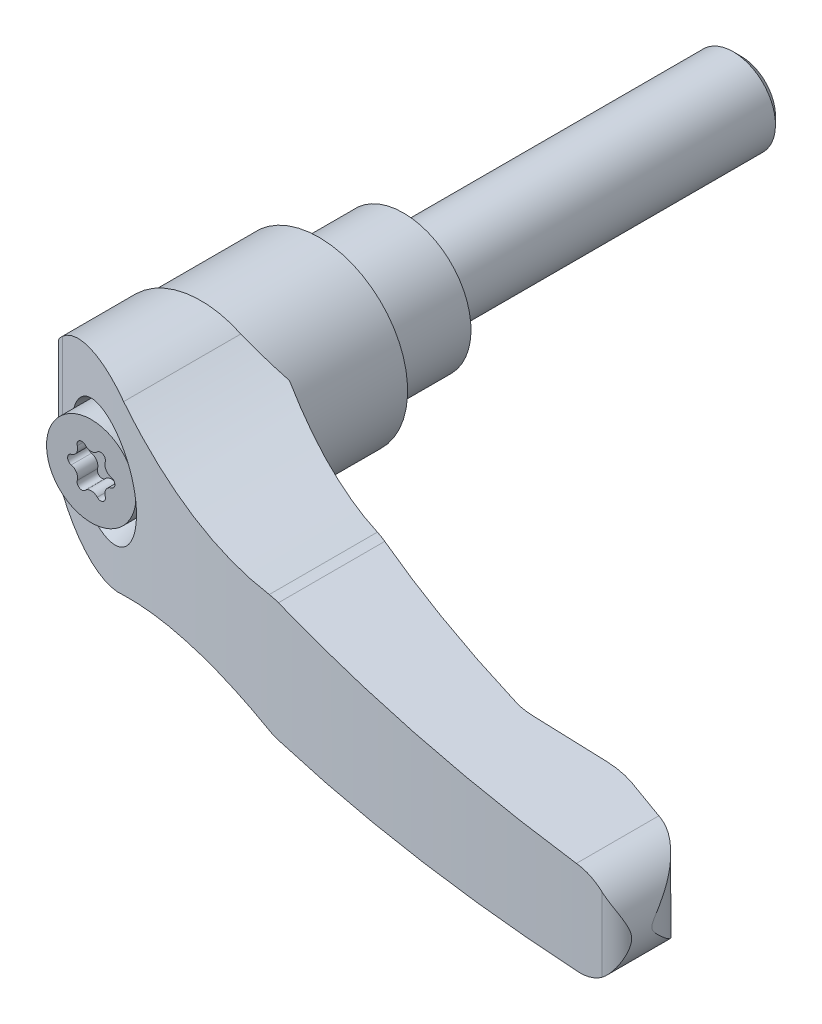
ISO-10303-21;
HEADER;
FILE_DESCRIPTION(('STEP AP214'),'2;1');
FILE_NAME('part.step','',(''),(''),'','','');
FILE_SCHEMA(('AUTOMOTIVE_DESIGN { 1 0 10303 214 1 1 1 1 }'));
ENDSEC;
DATA;
#1=APPLICATION_CONTEXT('core data for automotive mechanical design processes');
#2=APPLICATION_PROTOCOL_DEFINITION('international standard','automotive_design',2000,#1);
#3=PRODUCT_CONTEXT('',#1,'mechanical');
#4=PRODUCT('Part','Part','',(#3));
#5=PRODUCT_RELATED_PRODUCT_CATEGORY('part','',(#4));
#6=PRODUCT_DEFINITION_FORMATION('','',#4);
#7=PRODUCT_DEFINITION_CONTEXT('part definition',#1,'design');
#8=PRODUCT_DEFINITION('design','',#6,#7);
#9=PRODUCT_DEFINITION_SHAPE('','',#8);
#10=(LENGTH_UNIT() NAMED_UNIT(*) SI_UNIT(.MILLI.,.METRE.));
#11=(NAMED_UNIT(*) PLANE_ANGLE_UNIT() SI_UNIT($,.RADIAN.));
#12=(NAMED_UNIT(*) SI_UNIT($,.STERADIAN.) SOLID_ANGLE_UNIT());
#13=UNCERTAINTY_MEASURE_WITH_UNIT(LENGTH_MEASURE(1.E-05),#10,'distance_accuracy_value','');
#14=(GEOMETRIC_REPRESENTATION_CONTEXT(3) GLOBAL_UNCERTAINTY_ASSIGNED_CONTEXT((#13)) GLOBAL_UNIT_ASSIGNED_CONTEXT((#10,
#11,#12)) REPRESENTATION_CONTEXT('',''));
#15=CARTESIAN_POINT('',(0.,0.,0.));
#16=DIRECTION('',(0.,0.,1.));
#17=DIRECTION('',(1.,0.,0.));
#18=AXIS2_PLACEMENT_3D('',#15,#16,#17);
#19=CARTESIAN_POINT('',(0.,0.,-9.53924875));
#20=DIRECTION('',(0.,0.,-1.));
#21=DIRECTION('',(0.,1.,0.));
#22=AXIS2_PLACEMENT_3D('',#19,#20,#21);
#23=CYLINDRICAL_SURFACE('',#22,5.);
#24=CARTESIAN_POINT('',(0.,0.,-39.08));
#25=DIRECTION('',(0.,0.,-1.));
#26=DIRECTION('',(0.,1.,0.));
#27=AXIS2_PLACEMENT_3D('',#24,#25,#26);
#28=CIRCLE('',#27,5.);
#29=CARTESIAN_POINT('',(0.,5.,-39.08));
#30=VERTEX_POINT('',#29);
#31=EDGE_CURVE('E9',#30,#30,#28,.F.);
#32=ORIENTED_EDGE('',*,*,#31,.T.);
#33=EDGE_LOOP('',(#32));
#34=FACE_BOUND('',#33,.T.);
#35=CARTESIAN_POINT('',(0.,0.,0.));
#36=DIRECTION('',(0.,0.,-1.));
#37=DIRECTION('',(0.,1.,0.));
#38=AXIS2_PLACEMENT_3D('',#35,#36,#37);
#39=CIRCLE('',#38,5.);
#40=CARTESIAN_POINT('',(0.,5.,0.));
#41=VERTEX_POINT('',#40);
#42=EDGE_CURVE('E616',#41,#41,#39,.F.);
#43=ORIENTED_EDGE('',*,*,#42,.F.);
#44=EDGE_LOOP('',(#43));
#45=FACE_BOUND('',#44,.T.);
#46=ADVANCED_FACE('F14',(#34,#45),#23,.T.);
#47=CARTESIAN_POINT('',(6.5,0.,0.));
#48=DIRECTION('',(0.,0.,-1.));
#49=DIRECTION('',(0.,1.,0.));
#50=AXIS2_PLACEMENT_3D('',#47,#48,#49);
#51=PLANE('',#50);
#52=ORIENTED_EDGE('',*,*,#42,.T.);
#53=EDGE_LOOP('',(#52));
#54=FACE_BOUND('',#53,.T.);
#55=CARTESIAN_POINT('',(0.,0.,0.));
#56=DIRECTION('',(0.,0.,-1.));
#57=DIRECTION('',(0.,1.,0.));
#58=AXIS2_PLACEMENT_3D('',#55,#56,#57);
#59=CIRCLE('',#58,8.);
#60=CARTESIAN_POINT('',(0.,8.,0.));
#61=VERTEX_POINT('',#60);
#62=EDGE_CURVE('E699',#61,#61,#59,.F.);
#63=ORIENTED_EDGE('',*,*,#62,.F.);
#64=EDGE_LOOP('',(#63));
#65=FACE_BOUND('',#64,.T.);
#66=ADVANCED_FACE('F496',(#54,#65),#51,.T.);
#67=CARTESIAN_POINT('',(0.,0.,11.15));
#68=DIRECTION('',(0.,0.,-1.));
#69=DIRECTION('',(0.,1.,0.));
#70=AXIS2_PLACEMENT_3D('',#67,#68,#69);
#71=CYLINDRICAL_SURFACE('',#70,8.);
#72=ORIENTED_EDGE('',*,*,#62,.T.);
#73=EDGE_LOOP('',(#72));
#74=FACE_BOUND('',#73,.T.);
#75=CARTESIAN_POINT('',(0.,0.,10.7));
#76=DIRECTION('',(0.,0.,-1.));
#77=DIRECTION('',(1.,0.,0.));
#78=AXIS2_PLACEMENT_3D('',#75,#76,#77);
#79=CIRCLE('',#78,8.);
#80=CARTESIAN_POINT('',(8.,0.,10.7));
#81=VERTEX_POINT('',#80);
#82=EDGE_CURVE('E609',#81,#81,#79,.T.);
#83=ORIENTED_EDGE('',*,*,#82,.T.);
#84=EDGE_LOOP('',(#83));
#85=FACE_BOUND('',#84,.T.);
#86=ADVANCED_FACE('F487',(#74,#85),#71,.T.);
#87=CARTESIAN_POINT('',(0.,0.,10.4));
#88=DIRECTION('',(0.,0.,-1.));
#89=DIRECTION('',(0.,1.,0.));
#90=AXIS2_PLACEMENT_3D('',#87,#88,#89);
#91=CONICAL_SURFACE('',#90,8.3,0.785398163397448);
#92=ORIENTED_EDGE('',*,*,#82,.F.);
#93=EDGE_LOOP('',(#92));
#94=FACE_BOUND('',#93,.T.);
#95=CARTESIAN_POINT('',(0.,0.,10.4));
#96=DIRECTION('',(0.,0.,-1.));
#97=DIRECTION('',(0.,1.,0.));
#98=AXIS2_PLACEMENT_3D('',#95,#96,#97);
#99=CIRCLE('',#98,8.3);
#100=CARTESIAN_POINT('',(0.,8.3,10.4));
#101=VERTEX_POINT('',#100);
#102=EDGE_CURVE('E605',#101,#101,#99,.T.);
#103=ORIENTED_EDGE('',*,*,#102,.T.);
#104=EDGE_LOOP('',(#103));
#105=FACE_BOUND('',#104,.T.);
#106=ADVANCED_FACE('F483',(#94,#105),#91,.F.);
#107=CARTESIAN_POINT('',(0.,0.,9.7));
#108=DIRECTION('',(0.,0.,-1.));
#109=DIRECTION('',(0.,1.,0.));
#110=AXIS2_PLACEMENT_3D('',#107,#108,#109);
#111=CYLINDRICAL_SURFACE('',#110,8.3);
#112=ORIENTED_EDGE('',*,*,#102,.F.);
#113=EDGE_LOOP('',(#112));
#114=FACE_BOUND('',#113,.T.);
#115=CARTESIAN_POINT('',(0.,0.,10.));
#116=DIRECTION('',(0.,0.,-1.));
#117=DIRECTION('',(0.,1.,0.));
#118=AXIS2_PLACEMENT_3D('',#115,#116,#117);
#119=CIRCLE('',#118,8.3);
#120=CARTESIAN_POINT('',(0.,8.3,10.));
#121=VERTEX_POINT('',#120);
#122=EDGE_CURVE('E608',#121,#121,#119,.F.);
#123=ORIENTED_EDGE('',*,*,#122,.F.);
#124=EDGE_LOOP('',(#123));
#125=FACE_BOUND('',#124,.T.);
#126=ADVANCED_FACE('F479',(#114,#125),#111,.F.);
#127=CARTESIAN_POINT('',(-5.26,0.,10.));
#128=DIRECTION('',(0.,0.,-1.));
#129=DIRECTION('',(0.,1.,0.));
#130=AXIS2_PLACEMENT_3D('',#127,#128,#129);
#131=PLANE('',#130);
#132=CARTESIAN_POINT('',(-0.00999999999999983,0.,10.));
#133=DIRECTION('',(0.,0.,1.));
#134=DIRECTION('',(-1.,0.,0.));
#135=AXIS2_PLACEMENT_3D('',#132,#133,#134);
#136=CIRCLE('',#135,10.5);
#137=CARTESIAN_POINT('',(-10.2600377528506,-2.27743848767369,10.));
#138=VERTEX_POINT('',#137);
#139=CARTESIAN_POINT('',(-10.2600377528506,2.27743848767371,10.));
#140=VERTEX_POINT('',#139);
#141=EDGE_CURVE('E707',#138,#140,#136,.T.);
#142=ORIENTED_EDGE('',*,*,#141,.F.);
#143=DIRECTION('',(0.,-1.,0.));
#144=VECTOR('',#143,1.);
#145=CARTESIAN_POINT('',(-10.2600377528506,-22.,10.));
#146=LINE('',#145,#144);
#147=EDGE_CURVE('E706',#138,#140,#146,.F.);
#148=ORIENTED_EDGE('',*,*,#147,.T.);
#149=EDGE_LOOP('',(#142,#148));
#150=FACE_BOUND('',#149,.T.);
#151=ORIENTED_EDGE('',*,*,#122,.T.);
#152=EDGE_LOOP('',(#151));
#153=FACE_BOUND('',#152,.T.);
#154=ADVANCED_FACE('F475',(#150,#153),#131,.T.);
#155=CARTESIAN_POINT('',(-10.2600377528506,-22.,10.));
#156=DIRECTION('',(0.707106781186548,0.,0.707106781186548));
#157=DIRECTION('',(-0.707106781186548,0.,0.707106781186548));
#158=AXIS2_PLACEMENT_3D('',#155,#156,#157);
#159=PLANE('',#158);
#160=ORIENTED_EDGE('',*,*,#147,.F.);
#161=CARTESIAN_POINT('',(-0.00999999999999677,0.,-0.250037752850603));
#162=DIRECTION('',(0.707106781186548,0.,0.707106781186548));
#163=DIRECTION('',(-0.707106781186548,0.,0.707106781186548));
#164=AXIS2_PLACEMENT_3D('',#161,#162,#163);
#165=ELLIPSE('',#164,14.8492424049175,10.5);
#166=EDGE_CURVE('E709',#140,#138,#165,.T.);
#167=ORIENTED_EDGE('',*,*,#166,.F.);
#168=EDGE_LOOP('',(#160,#167));
#169=FACE_BOUND('',#168,.T.);
#170=ADVANCED_FACE('F471',(#169),#159,.F.);
#171=CARTESIAN_POINT('',(-0.0100000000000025,0.,18.90625));
#172=DIRECTION('',(0.,0.,1.));
#173=DIRECTION('',(-1.,0.,0.));
#174=AXIS2_PLACEMENT_3D('',#171,#172,#173);
#175=CYLINDRICAL_SURFACE('',#174,10.5);
#176=CARTESIAN_POINT('',(-0.010000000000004,0.,24.));
#177=DIRECTION('',(0.,0.,1.));
#178=DIRECTION('',(-1.,0.,0.));
#179=AXIS2_PLACEMENT_3D('',#176,#177,#178);
#180=CIRCLE('',#179,10.5);
#181=CARTESIAN_POINT('',(-10.51,0.,24.));
#182=VERTEX_POINT('',#181);
#183=CARTESIAN_POINT('',(10.49,0.,24.));
#184=VERTEX_POINT('',#183);
#185=EDGE_CURVE('E456',#182,#184,#180,.T.);
#186=ORIENTED_EDGE('',*,*,#185,.F.);
#187=CARTESIAN_POINT('',(-0.010000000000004,0.,24.));
#188=DIRECTION('',(0.,0.,1.));
#189=DIRECTION('',(-1.,0.,0.));
#190=AXIS2_PLACEMENT_3D('',#187,#188,#189);
#191=CIRCLE('',#190,10.5);
#192=EDGE_CURVE('E591',#184,#182,#191,.T.);
#193=ORIENTED_EDGE('',*,*,#192,.F.);
#194=EDGE_LOOP('',(#186,#193));
#195=FACE_BOUND('',#194,.T.);
#196=ORIENTED_EDGE('',*,*,#141,.T.);
#197=ORIENTED_EDGE('',*,*,#166,.T.);
#198=EDGE_LOOP('',(#196,#197));
#199=FACE_BOUND('',#198,.T.);
#200=ADVANCED_FACE('F467',(#195,#199),#175,.T.);
#201=CARTESIAN_POINT('',(-10.51,-12.,24.));
#202=DIRECTION('',(0.,0.,-1.));
#203=DIRECTION('',(0.,1.,0.));
#204=AXIS2_PLACEMENT_3D('',#201,#202,#203);
#205=PLANE('',#204);
#206=ORIENTED_EDGE('',*,*,#185,.T.);
#207=DIRECTION('',(0.,-1.,0.));
#208=VECTOR('',#207,1.);
#209=CARTESIAN_POINT('',(10.4900000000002,-12.,23.9999999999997));
#210=LINE('',#209,#208);
#211=CARTESIAN_POINT('',(10.4900000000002,-8.03465812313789,24.));
#212=VERTEX_POINT('',#211);
#213=EDGE_CURVE('E442',#184,#212,#210,.T.);
#214=ORIENTED_EDGE('',*,*,#213,.T.);
#215=CARTESIAN_POINT('',(22.94,-55.53,24.));
#216=DIRECTION('',(0.,0.,1.));
#217=DIRECTION('',(0.,-1.,0.));
#218=AXIS2_PLACEMENT_3D('',#215,#216,#217);
#219=CIRCLE('',#218,49.1);
#220=CARTESIAN_POINT('',(4.72251026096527,-9.93468151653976,24.));
#221=VERTEX_POINT('',#220);
#222=EDGE_CURVE('E746',#212,#221,#219,.T.);
#223=ORIENTED_EDGE('',*,*,#222,.T.);
#224=CARTESIAN_POINT('',(0.,0.,24.));
#225=DIRECTION('',(0.,0.,1.));
#226=DIRECTION('',(0.,-1.,0.));
#227=AXIS2_PLACEMENT_3D('',#224,#225,#226);
#228=CIRCLE('',#227,11.);
#229=CARTESIAN_POINT('',(-10.51,-3.24652121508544,24.));
#230=VERTEX_POINT('',#229);
#231=EDGE_CURVE('E740',#230,#221,#228,.T.);
#232=ORIENTED_EDGE('',*,*,#231,.F.);
#233=DIRECTION('',(0.,-1.,0.));
#234=VECTOR('',#233,1.);
#235=CARTESIAN_POINT('',(-10.51,-12.,24.));
#236=LINE('',#235,#234);
#237=EDGE_CURVE('E590',#182,#230,#236,.T.);
#238=ORIENTED_EDGE('',*,*,#237,.F.);
#239=EDGE_LOOP('',(#206,#214,#223,#232,#238));
#240=FACE_BOUND('',#239,.T.);
#241=ADVANCED_FACE('F462',(#240),#205,.T.);
#242=CARTESIAN_POINT('',(31.3589689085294,0.945932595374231,54.5));
#243=DIRECTION('',(0.,0.,1.));
#244=DIRECTION('',(0.,-1.,0.));
#245=AXIS2_PLACEMENT_3D('',#242,#243,#244);
#246=CYLINDRICAL_SURFACE('',#245,8.00000000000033);
#247=CARTESIAN_POINT('',(31.6479325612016,-7.04884695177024,46.4731806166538));
#248=CARTESIAN_POINT('',(31.4018180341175,-7.05768532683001,46.4087993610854));
#249=CARTESIAN_POINT('',(31.1563854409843,-7.05525330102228,46.3442255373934));
#250=CARTESIAN_POINT('',(30.66688412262,-7.02784844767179,46.2146927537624));
#251=CARTESIAN_POINT('',(30.4228153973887,-7.00287562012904,46.1497337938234));
#252=CARTESIAN_POINT('',(30.1794286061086,-6.96663239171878,46.0845822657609));
#253=B_SPLINE_CURVE_WITH_KNOTS('',3,(#247,#248,#249,#250,#251,#252),.UNSPECIFIED.,.F.,.F.,(4,2,
4),(0.,0.76139061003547,1.52278122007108),.UNSPECIFIED.);
#254=CARTESIAN_POINT('',(31.6479325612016,-7.04884695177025,46.4731806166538));
#255=VERTEX_POINT('',#254);
#256=CARTESIAN_POINT('',(30.1794286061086,-6.96663239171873,46.084582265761));
#257=VERTEX_POINT('',#256);
#258=EDGE_CURVE('E449',#255,#257,#253,.T.);
#259=ORIENTED_EDGE('',*,*,#258,.T.);
#260=DIRECTION('',(0.,0.,1.));
#261=VECTOR('',#260,1.);
#262=CARTESIAN_POINT('',(30.1794286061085,-6.96663239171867,54.5));
#263=LINE('',#262,#261);
#264=CARTESIAN_POINT('',(30.1794286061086,-6.96663239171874,33.2732494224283));
#265=VERTEX_POINT('',#264);
#266=EDGE_CURVE('E741',#257,#265,#263,.F.);
#267=ORIENTED_EDGE('',*,*,#266,.T.);
#268=CARTESIAN_POINT('',(30.1794286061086,-6.9666323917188,33.2732494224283));
#269=CARTESIAN_POINT('',(30.4222007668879,-7.00282816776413,33.3728739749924));
#270=CARTESIAN_POINT('',(30.6665043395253,-7.02781937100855,33.4725985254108));
#271=CARTESIAN_POINT('',(31.0339219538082,-7.04840105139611,33.6217860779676));
#272=CARTESIAN_POINT('',(31.1565128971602,-7.05244559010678,33.6714318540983));
#273=CARTESIAN_POINT('',(31.4020580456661,-7.05489552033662,33.7706062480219));
#274=CARTESIAN_POINT('',(31.5250125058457,-7.05329063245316,33.8201344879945));
#275=CARTESIAN_POINT('',(31.6479325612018,-7.04884695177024,33.8695155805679));
#276=B_SPLINE_CURVE_WITH_KNOTS('',3,(#268,#269,#270,#271,#272,#273,#274,#275),.UNSPECIFIED.,.F.,
.F.,(4,2,2,4),(0.,0.794258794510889,1.19111760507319,1.58869889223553),.UNSPECIFIED.);
#277=CARTESIAN_POINT('',(31.6479325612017,-7.04884695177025,33.8695155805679));
#278=VERTEX_POINT('',#277);
#279=EDGE_CURVE('E444',#265,#278,#276,.T.);
#280=ORIENTED_EDGE('',*,*,#279,.T.);
#281=DIRECTION('',(0.,0.,1.));
#282=VECTOR('',#281,1.);
#283=CARTESIAN_POINT('',(31.6479325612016,-7.04884695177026,54.5));
#284=LINE('',#283,#282);
#285=EDGE_CURVE('E751',#278,#255,#284,.T.);
#286=ORIENTED_EDGE('',*,*,#285,.T.);
#287=EDGE_LOOP('',(#259,#267,#280,#286));
#288=FACE_BOUND('',#287,.T.);
#289=ADVANCED_FACE('F458',(#288),#246,.T.);
#290=CARTESIAN_POINT('',(79.9967051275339,-12.,50.5395921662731));
#291=DIRECTION('',(0.992331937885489,0.,-0.123601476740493));
#292=DIRECTION('',(0.123601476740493,0.,0.992331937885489));
#293=AXIS2_PLACEMENT_3D('',#290,#291,#292);
#294=PLANE('',#293);
#295=CARTESIAN_POINT('',(79.9967051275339,-0.190348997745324,50.5395921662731));
#296=CARTESIAN_POINT('',(79.9969785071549,-0.182455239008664,50.5417867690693));
#297=CARTESIAN_POINT('',(79.9972360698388,-0.174525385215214,50.543854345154));
#298=CARTESIAN_POINT('',(79.9977166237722,-0.158664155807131,50.5477118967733));
#299=CARTESIAN_POINT('',(79.9979398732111,-0.150733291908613,50.5495039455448));
#300=CARTESIAN_POINT('',(79.9983518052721,-0.134870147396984,50.5528105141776));
#301=CARTESIAN_POINT('',(79.998540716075,-0.12693825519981,50.5543268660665));
#302=CARTESIAN_POINT('',(79.9988840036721,-0.111073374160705,50.5570823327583));
#303=CARTESIAN_POINT('',(79.9990385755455,-0.103140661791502,50.5583230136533));
#304=CARTESIAN_POINT('',(79.9993132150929,-0.087274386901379,50.5605274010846));
#305=CARTESIAN_POINT('',(79.9994334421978,-0.0793410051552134,50.5614923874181));
#306=CARTESIAN_POINT('',(79.9996394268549,-0.0634736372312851,50.5631456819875));
#307=CARTESIAN_POINT('',(79.9997253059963,-0.0555397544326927,50.5638349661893));
#308=CARTESIAN_POINT('',(79.9998626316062,-0.0396716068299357,50.5649371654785));
#309=CARTESIAN_POINT('',(79.9999141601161,-0.0317373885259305,50.5653507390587));
#310=CARTESIAN_POINT('',(79.9999828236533,-0.0158687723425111,50.5659018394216));
#311=CARTESIAN_POINT('',(80.,-0.00793438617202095,50.5660396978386));
#312=CARTESIAN_POINT('',(80.,0.00793438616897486,50.5660396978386));
#313=CARTESIAN_POINT('',(79.9999828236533,0.0158687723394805,50.5659018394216));
#314=CARTESIAN_POINT('',(79.9999141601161,0.0317373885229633,50.5653507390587));
#315=CARTESIAN_POINT('',(79.9998626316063,0.0396716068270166,50.5649371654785));
#316=CARTESIAN_POINT('',(79.9997253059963,0.0555397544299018,50.5638349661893));
#317=CARTESIAN_POINT('',(79.9996394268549,0.0634736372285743,50.5631456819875));
#318=CARTESIAN_POINT('',(79.9994334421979,0.0793410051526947,50.5614923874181));
#319=CARTESIAN_POINT('',(79.9993132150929,0.0872743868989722,50.5605274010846));
#320=CARTESIAN_POINT('',(79.9990385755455,0.103140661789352,50.5583230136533));
#321=CARTESIAN_POINT('',(79.9988840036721,0.111073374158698,50.5570823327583));
#322=CARTESIAN_POINT('',(79.998540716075,0.126938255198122,50.5543268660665));
#323=CARTESIAN_POINT('',(79.9983518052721,0.134870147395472,50.5528105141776));
#324=CARTESIAN_POINT('',(79.9979398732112,0.150733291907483,50.5495039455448));
#325=CARTESIAN_POINT('',(79.9977166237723,0.158664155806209,50.5477118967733));
#326=CARTESIAN_POINT('',(79.9972360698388,0.174525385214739,50.543854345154));
#327=CARTESIAN_POINT('',(79.9969785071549,0.182455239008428,50.5417867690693));
#328=CARTESIAN_POINT('',(79.9967051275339,0.190348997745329,50.5395921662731));
#329=B_SPLINE_CURVE_WITH_KNOTS('',3,(#295,#296,#297,#298,#299,#300,#301,#302,#303,#304,#305,
#306,#307,#308,#309,#310,#311,#312,#313,#314,#315,#316,#317,#318,#319,#320,#321,#322,#323,#324,
#325,#326,#327,#328),.UNSPECIFIED.,.F.,.F.,(4,2,2,2,2,2,2,2,2,2,2,2,2,2,2,2,4),(0.,
0.0245923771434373,0.0489895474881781,0.0732181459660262,0.0973053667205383,0.121278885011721,
0.145166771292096,0.168997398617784,0.19279934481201,0.216601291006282,0.240431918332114,
0.264319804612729,0.288293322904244,0.312380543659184,0.336609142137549,0.361006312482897,
0.385598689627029),.UNSPECIFIED.);
#330=CARTESIAN_POINT('',(79.9967051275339,-0.190348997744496,50.5395921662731));
#331=VERTEX_POINT('',#330);
#332=CARTESIAN_POINT('',(79.9967051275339,0.190348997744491,50.5395921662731));
#333=VERTEX_POINT('',#332);
#334=EDGE_CURVE('E370',#331,#333,#329,.T.);
#335=ORIENTED_EDGE('',*,*,#334,.F.);
#336=DIRECTION('',(0.,-1.,0.));
#337=VECTOR('',#336,1.);
#338=CARTESIAN_POINT('',(79.9967051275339,-12.,50.5395921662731));
#339=LINE('',#338,#337);
#340=EDGE_CURVE('E455',#333,#331,#339,.T.);
#341=ORIENTED_EDGE('',*,*,#340,.F.);
#342=EDGE_LOOP('',(#335,#341));
#343=FACE_BOUND('',#342,.T.);
#344=ADVANCED_FACE('F399',(#343),#294,.T.);
#345=CARTESIAN_POINT('',(72.6137555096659,-12.,51.4591871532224));
#346=DIRECTION('',(0.,-1.,0.));
#347=DIRECTION('',(1.,0.,0.));
#348=AXIS2_PLACEMENT_3D('',#345,#346,#347);
#349=CYLINDRICAL_SURFACE('',#348,7.44);
#350=CARTESIAN_POINT('',(79.9967051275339,0.190348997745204,50.5395921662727));
#351=CARTESIAN_POINT('',(79.9951469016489,0.235214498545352,50.5270575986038));
#352=CARTESIAN_POINT('',(79.9930953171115,0.27873685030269,50.5108629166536));
#353=CARTESIAN_POINT('',(79.988164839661,0.363077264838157,50.4732708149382));
#354=CARTESIAN_POINT('',(79.9852922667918,0.40391316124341,50.4519133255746));
#355=CARTESIAN_POINT('',(79.975702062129,0.52245816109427,50.3833482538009));
#356=CARTESIAN_POINT('',(79.9679715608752,0.597169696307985,50.3312876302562));
#357=CARTESIAN_POINT('',(79.9508869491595,0.736456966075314,50.2251559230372));
#358=CARTESIAN_POINT('',(79.9416856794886,0.801375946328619,50.1714851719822));
#359=CARTESIAN_POINT('',(79.9214540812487,0.928420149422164,50.0612288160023));
#360=CARTESIAN_POINT('',(79.9104232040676,0.990544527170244,50.0046423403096));
#361=CARTESIAN_POINT('',(79.8746515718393,1.17419942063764,49.8323129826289));
#362=CARTESIAN_POINT('',(79.8472488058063,1.29287988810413,49.7141099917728));
#363=CARTESIAN_POINT('',(79.7848398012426,1.52823594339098,49.4729704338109));
#364=CARTESIAN_POINT('',(79.7496926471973,1.64482416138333,49.3499864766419));
#365=CARTESIAN_POINT('',(79.6721004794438,1.87458318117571,49.1033284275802));
#366=CARTESIAN_POINT('',(79.6296610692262,1.98775652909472,48.9796549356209));
#367=CARTESIAN_POINT('',(79.5033816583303,2.29352791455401,48.6415502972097));
#368=CARTESIAN_POINT('',(79.4120558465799,2.48329449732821,48.427296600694));
#369=CARTESIAN_POINT('',(79.2061355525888,2.85434488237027,48.0023120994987));
#370=CARTESIAN_POINT('',(79.0915236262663,3.03562219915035,47.7915840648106));
#371=CARTESIAN_POINT('',(78.8390032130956,3.38665877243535,47.3777391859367));
#372=CARTESIAN_POINT('',(78.7012752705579,3.5564939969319,47.1745772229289));
#373=CARTESIAN_POINT('',(78.4009143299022,3.88356808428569,46.7768350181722));
#374=CARTESIAN_POINT('',(78.2383021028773,4.04081728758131,46.5822477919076));
#375=CARTESIAN_POINT('',(77.9568022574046,4.2801698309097,46.2794503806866));
#376=CARTESIAN_POINT('',(77.8461272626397,4.36735584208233,46.1675710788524));
#377=CARTESIAN_POINT('',(77.61512986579,4.53501217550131,45.9487274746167));
#378=CARTESIAN_POINT('',(77.494805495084,4.61548112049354,45.8417641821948));
#379=CARTESIAN_POINT('',(77.2447591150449,4.7684092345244,45.6339165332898));
#380=CARTESIAN_POINT('',(77.1150589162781,4.84088606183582,45.5330190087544));
#381=CARTESIAN_POINT('',(76.8461728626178,4.97676025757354,45.3380932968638));
#382=CARTESIAN_POINT('',(76.7069926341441,5.04016294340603,45.2440611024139));
#383=CARTESIAN_POINT('',(76.4438690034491,5.14664435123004,45.0792448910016));
#384=CARTESIAN_POINT('',(76.3213555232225,5.19134589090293,45.0072256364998));
#385=CARTESIAN_POINT('',(76.0703754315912,5.27269544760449,44.8693561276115));
#386=CARTESIAN_POINT('',(75.9419112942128,5.30934677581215,44.8035033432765));
#387=CARTESIAN_POINT('',(75.678496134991,5.37397975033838,44.6781572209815));
#388=CARTESIAN_POINT('',(75.5435027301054,5.40189236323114,44.6187168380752));
#389=CARTESIAN_POINT('',(75.2686009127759,5.44782102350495,44.507386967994));
#390=CARTESIAN_POINT('',(75.1286862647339,5.46582399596,44.4555075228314));
#391=CARTESIAN_POINT('',(74.9868127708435,5.47841339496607,44.407790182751));
#392=B_SPLINE_CURVE_WITH_KNOTS('',3,(#350,#351,#352,#353,#354,#355,#356,#357,#358,#359,#360,
#361,#362,#363,#364,#365,#366,#367,#368,#369,#370,#371,#372,#373,#374,#375,#376,#377,#378,#379,
#380,#381,#382,#383,#384,#385,#386,#387,#388,#389,#390,#391),.UNSPECIFIED.,.F.,.F.,(4,2,2,2,2,2,
2,2,2,2,2,2,2,2,2,2,2,2,2,2,4),(0.,0.139245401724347,0.277446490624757,0.550810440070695,
0.804906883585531,1.05907965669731,1.56794086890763,2.08696422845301,2.60559053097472,
3.50582150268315,4.40672935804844,5.30090298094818,6.1943342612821,6.73367946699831,
7.27313498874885,7.81137365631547,8.3492956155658,8.79580649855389,9.24213337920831,
9.69190199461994,10.1422626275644),.UNSPECIFIED.);
#393=CARTESIAN_POINT('',(74.9868127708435,5.47841339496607,44.407790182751));
#394=VERTEX_POINT('',#393);
#395=EDGE_CURVE('E387',#333,#394,#392,.T.);
#396=ORIENTED_EDGE('',*,*,#395,.F.);
#397=ORIENTED_EDGE('',*,*,#340,.T.);
#398=CARTESIAN_POINT('',(74.9868127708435,-5.47841339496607,44.407790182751));
#399=CARTESIAN_POINT('',(75.1398120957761,-5.46484028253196,44.459242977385));
#400=CARTESIAN_POINT('',(75.2905169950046,-5.44496899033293,44.5155387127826));
#401=CARTESIAN_POINT('',(75.5860882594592,-5.39377415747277,44.6368581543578));
#402=CARTESIAN_POINT('',(75.7309637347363,-5.36246932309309,44.7018674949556));
#403=CARTESIAN_POINT('',(76.0125967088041,-5.28989557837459,44.8390817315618));
#404=CARTESIAN_POINT('',(76.1494251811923,-5.24873835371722,44.9112009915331));
#405=CARTESIAN_POINT('',(76.4161065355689,-5.15736483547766,45.0623731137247));
#406=CARTESIAN_POINT('',(76.5459558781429,-5.10714400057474,45.1414294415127));
#407=CARTESIAN_POINT('',(76.8276536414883,-4.98604991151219,45.3247681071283));
#408=CARTESIAN_POINT('',(76.9775772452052,-4.91309116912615,45.4306358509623));
#409=CARTESIAN_POINT('',(77.265789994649,-4.75681575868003,45.6501400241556));
#410=CARTESIAN_POINT('',(77.4040776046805,-4.67349772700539,45.7637774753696));
#411=CARTESIAN_POINT('',(77.8028296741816,-4.40945601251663,46.1156758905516));
#412=CARTESIAN_POINT('',(78.0457801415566,-4.21527563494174,46.3639882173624));
#413=CARTESIAN_POINT('',(78.417694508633,-3.86589184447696,46.7984433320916));
#414=CARTESIAN_POINT('',(78.5586476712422,-3.71726415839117,46.9799982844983));
#415=CARTESIAN_POINT('',(78.8199419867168,-3.41009407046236,47.3496806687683));
#416=CARTESIAN_POINT('',(78.940273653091,-3.25154715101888,47.537811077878));
#417=CARTESIAN_POINT('',(79.1607378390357,-2.92676895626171,47.9181651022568));
#418=CARTESIAN_POINT('',(79.2609186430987,-2.76055725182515,48.1103776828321));
#419=CARTESIAN_POINT('',(79.4421677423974,-2.42115236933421,48.4974286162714));
#420=CARTESIAN_POINT('',(79.5232445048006,-2.24796232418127,48.692265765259));
#421=CARTESIAN_POINT('',(79.6578968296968,-1.91676087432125,49.0578102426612));
#422=CARTESIAN_POINT('',(79.7136489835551,-1.75958096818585,49.2284695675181));
#423=CARTESIAN_POINT('',(79.786963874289,-1.51825146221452,49.4826945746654));
#424=CARTESIAN_POINT('',(79.8097141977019,-1.43673320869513,49.567289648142));
#425=CARTESIAN_POINT('',(79.8517302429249,-1.27132927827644,49.7350141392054));
#426=CARTESIAN_POINT('',(79.870996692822,-1.18744410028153,49.8181438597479));
#427=CARTESIAN_POINT('',(79.9071865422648,-1.01046435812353,49.9869732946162));
#428=CARTESIAN_POINT('',(79.9238666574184,-0.917129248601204,50.0724723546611));
#429=CARTESIAN_POINT('',(79.9529450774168,-0.724505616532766,50.2358460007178));
#430=CARTESIAN_POINT('',(79.9653823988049,-0.625281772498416,50.3137850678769));
#431=CARTESIAN_POINT('',(79.9802376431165,-0.468580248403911,50.4153149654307));
#432=CARTESIAN_POINT('',(79.9845030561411,-0.416215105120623,50.4460963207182));
#433=CARTESIAN_POINT('',(79.9917045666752,-0.30687937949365,50.4998809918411));
#434=CARTESIAN_POINT('',(79.9946243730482,-0.249861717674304,50.5227881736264));
#435=CARTESIAN_POINT('',(79.9967051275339,-0.190348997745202,50.5395921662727));
#436=B_SPLINE_CURVE_WITH_KNOTS('',3,(#398,#399,#400,#401,#402,#403,#404,#405,#406,#407,#408,
#409,#410,#411,#412,#413,#414,#415,#416,#417,#418,#419,#420,#421,#422,#423,#424,#425,#426,#427,
#428,#429,#430,#431,#432,#433,#434,#435),.UNSPECIFIED.,.F.,.F.,(4,2,2,2,2,2,2,2,2,2,2,2,2,2,2,2,
2,2,4),(0.,0.485611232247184,0.970431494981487,1.44999646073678,1.92980238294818,
2.52141817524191,3.11311192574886,4.30183389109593,5.12208341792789,5.94270927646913,
6.76134473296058,7.57961667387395,8.29494630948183,8.65387747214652,9.01273353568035,
9.39561932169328,9.77488268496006,9.95698827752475,10.141244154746),.UNSPECIFIED.);
#437=CARTESIAN_POINT('',(74.9868127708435,-5.47841339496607,44.407790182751));
#438=VERTEX_POINT('',#437);
#439=EDGE_CURVE('E359',#438,#331,#436,.T.);
#440=ORIENTED_EDGE('',*,*,#439,.F.);
#441=DIRECTION('',(0.,-1.,0.));
#442=VECTOR('',#441,1.);
#443=CARTESIAN_POINT('',(74.9868127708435,-12.,44.407790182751));
#444=LINE('',#443,#442);
#445=EDGE_CURVE('E443',#394,#438,#444,.T.);
#446=ORIENTED_EDGE('',*,*,#445,.F.);
#447=EDGE_LOOP('',(#396,#397,#440,#446));
#448=FACE_BOUND('',#447,.T.);
#449=ADVANCED_FACE('F393',(#448),#349,.T.);
#450=CARTESIAN_POINT('',(57.3760512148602,-12.,33.47));
#451=DIRECTION('',(0.,-1.,0.));
#452=DIRECTION('',(1.,0.,0.));
#453=AXIS2_PLACEMENT_3D('',#450,#451,#452);
#454=CYLINDRICAL_SURFACE('',#453,8.58999999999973);
#455=DIRECTION('',(0.,-1.,0.));
#456=VECTOR('',#455,1.);
#457=CARTESIAN_POINT('',(55.1138126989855,-12.,41.756759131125));
#458=LINE('',#457,#456);
#459=CARTESIAN_POINT('',(55.1138126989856,-6.20069518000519,41.7567591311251));
#460=VERTEX_POINT('',#459);
#461=CARTESIAN_POINT('',(55.1138126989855,6.2006951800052,41.7567591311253));
#462=VERTEX_POINT('',#461);
#463=EDGE_CURVE('E735',#460,#462,#458,.F.);
#464=ORIENTED_EDGE('',*,*,#463,.T.);
#465=CARTESIAN_POINT('',(57.3760512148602,6.11892873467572,33.47));
#466=DIRECTION('',(-0.0361204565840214,-0.999347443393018,0.));
#467=DIRECTION('',(0.999347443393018,-0.0361204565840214,0.));
#468=AXIS2_PLACEMENT_3D('',#465,#466,#467);
#469=ELLIPSE('',#468,8.59560912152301,8.58999999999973);
#470=CARTESIAN_POINT('',(57.3760512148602,6.11892873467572,42.06));
#471=VERTEX_POINT('',#470);
#472=EDGE_CURVE('E816',#462,#471,#469,.F.);
#473=ORIENTED_EDGE('',*,*,#472,.T.);
#474=DIRECTION('',(0.,1.,0.));
#475=VECTOR('',#474,1.);
#476=CARTESIAN_POINT('',(57.3760512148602,-12.,42.06));
#477=LINE('',#476,#475);
#478=CARTESIAN_POINT('',(57.3760512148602,-6.11892873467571,42.06));
#479=VERTEX_POINT('',#478);
#480=EDGE_CURVE('E596',#479,#471,#477,.T.);
#481=ORIENTED_EDGE('',*,*,#480,.F.);
#482=CARTESIAN_POINT('',(57.3760512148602,-6.11892873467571,33.47));
#483=DIRECTION('',(-0.0361204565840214,0.999347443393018,0.));
#484=DIRECTION('',(-0.999347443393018,-0.0361204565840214,0.));
#485=AXIS2_PLACEMENT_3D('',#482,#483,#484);
#486=ELLIPSE('',#485,8.59560912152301,8.58999999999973);
#487=EDGE_CURVE('E756',#479,#460,#486,.F.);
#488=ORIENTED_EDGE('',*,*,#487,.T.);
#489=EDGE_LOOP('',(#464,#473,#481,#488));
#490=FACE_BOUND('',#489,.T.);
#491=ADVANCED_FACE('F398',(#490),#454,.F.);
#492=CARTESIAN_POINT('',(57.3760512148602,-12.,42.06));
#493=DIRECTION('',(0.,0.,-1.));
#494=DIRECTION('',(0.,1.,0.));
#495=AXIS2_PLACEMENT_3D('',#492,#493,#494);
#496=PLANE('',#495);
#497=DIRECTION('',(0.999347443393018,-0.0361204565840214,0.));
#498=VECTOR('',#497,1.);
#499=CARTESIAN_POINT('',(31.6479325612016,7.04884695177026,42.06));
#500=LINE('',#499,#498);
#501=CARTESIAN_POINT('',(66.1633245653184,5.80132115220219,42.06));
#502=VERTEX_POINT('',#501);
#503=EDGE_CURVE('E813',#471,#502,#500,.T.);
#504=ORIENTED_EDGE('',*,*,#503,.T.);
#505=DIRECTION('',(0.,-1.,0.));
#506=VECTOR('',#505,1.);
#507=CARTESIAN_POINT('',(66.1633245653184,-12.,42.06));
#508=LINE('',#507,#506);
#509=CARTESIAN_POINT('',(66.1633245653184,-5.80132115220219,42.06));
#510=VERTEX_POINT('',#509);
#511=EDGE_CURVE('E595',#510,#502,#508,.F.);
#512=ORIENTED_EDGE('',*,*,#511,.F.);
#513=DIRECTION('',(-0.999347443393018,-0.0361204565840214,0.));
#514=VECTOR('',#513,1.);
#515=CARTESIAN_POINT('',(74.5,-5.5,42.06));
#516=LINE('',#515,#514);
#517=EDGE_CURVE('E754',#510,#479,#516,.T.);
#518=ORIENTED_EDGE('',*,*,#517,.T.);
#519=ORIENTED_EDGE('',*,*,#480,.T.);
#520=EDGE_LOOP('',(#504,#512,#518,#519));
#521=FACE_BOUND('',#520,.T.);
#522=ADVANCED_FACE('F405',(#521),#496,.T.);
#523=CARTESIAN_POINT('',(66.1633245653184,-12.,53.34));
#524=DIRECTION('',(0.,-1.,0.));
#525=DIRECTION('',(1.,0.,0.));
#526=AXIS2_PLACEMENT_3D('',#523,#524,#525);
#527=CYLINDRICAL_SURFACE('',#526,11.2800000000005);
#528=CARTESIAN_POINT('',(66.1633245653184,5.80132115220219,53.34));
#529=DIRECTION('',(-0.0361204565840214,-0.999347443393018,0.));
#530=DIRECTION('',(0.999347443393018,-0.0361204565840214,0.));
#531=AXIS2_PLACEMENT_3D('',#528,#529,#530);
#532=ELLIPSE('',#531,11.2873656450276,11.2800000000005);
#533=CARTESIAN_POINT('',(69.7611855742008,5.6712799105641,42.6491723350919));
#534=VERTEX_POINT('',#533);
#535=EDGE_CURVE('E815',#502,#534,#532,.T.);
#536=ORIENTED_EDGE('',*,*,#535,.T.);
#537=DIRECTION('',(0.,-1.,0.));
#538=VECTOR('',#537,1.);
#539=CARTESIAN_POINT('',(69.7611855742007,-12.,42.6491723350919));
#540=LINE('',#539,#538);
#541=CARTESIAN_POINT('',(69.7611855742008,-5.6712799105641,42.6491723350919));
#542=VERTEX_POINT('',#541);
#543=EDGE_CURVE('E592',#542,#534,#540,.F.);
#544=ORIENTED_EDGE('',*,*,#543,.F.);
#545=CARTESIAN_POINT('',(66.1633245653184,-5.80132115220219,53.34));
#546=DIRECTION('',(-0.0361204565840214,0.999347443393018,0.));
#547=DIRECTION('',(-0.999347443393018,-0.0361204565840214,0.));
#548=AXIS2_PLACEMENT_3D('',#545,#546,#547);
#549=ELLIPSE('',#548,11.2873656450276,11.2800000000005);
#550=EDGE_CURVE('E757',#542,#510,#549,.T.);
#551=ORIENTED_EDGE('',*,*,#550,.T.);
#552=ORIENTED_EDGE('',*,*,#511,.T.);
#553=EDGE_LOOP('',(#536,#544,#551,#552));
#554=FACE_BOUND('',#553,.T.);
#555=ADVANCED_FACE('F409',(#554),#527,.T.);
#556=CARTESIAN_POINT('',(69.7611855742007,-12.,42.6491723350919));
#557=DIRECTION('',(0.318959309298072,0.,-0.947768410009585));
#558=DIRECTION('',(0.947768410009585,0.,0.318959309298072));
#559=AXIS2_PLACEMENT_3D('',#556,#557,#558);
#560=PLANE('',#559);
#561=ORIENTED_EDGE('',*,*,#445,.T.);
#562=CARTESIAN_POINT('',(74.5,0.,44.2439595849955));
#563=DIRECTION('',(0.318959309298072,0.,-0.947768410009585));
#564=DIRECTION('',(0.947768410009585,0.,0.318959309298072));
#565=AXIS2_PLACEMENT_3D('',#562,#563,#564);
#566=ELLIPSE('',#565,5.80310542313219,5.5);
#567=CARTESIAN_POINT('',(74.5,-5.5,44.2439595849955));
#568=VERTEX_POINT('',#567);
#569=EDGE_CURVE('E750',#568,#438,#566,.F.);
#570=ORIENTED_EDGE('',*,*,#569,.F.);
#571=DIRECTION('',(-0.947212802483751,-0.0342360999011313,-0.318772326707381));
#572=VECTOR('',#571,1.);
#573=CARTESIAN_POINT('',(74.5,-5.5,44.2439595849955));
#574=LINE('',#573,#572);
#575=EDGE_CURVE('E747',#568,#542,#574,.T.);
#576=ORIENTED_EDGE('',*,*,#575,.T.);
#577=ORIENTED_EDGE('',*,*,#543,.T.);
#578=DIRECTION('',(0.947212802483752,-0.0342360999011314,0.31877232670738));
#579=VECTOR('',#578,1.);
#580=CARTESIAN_POINT('',(69.7611855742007,5.6712799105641,42.6491723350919));
#581=LINE('',#580,#579);
#582=CARTESIAN_POINT('',(74.5,5.5,44.2439595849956));
#583=VERTEX_POINT('',#582);
#584=EDGE_CURVE('E809',#534,#583,#581,.T.);
#585=ORIENTED_EDGE('',*,*,#584,.T.);
#586=CARTESIAN_POINT('',(74.5,0.,44.2439595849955));
#587=DIRECTION('',(0.318959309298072,0.,-0.947768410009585));
#588=DIRECTION('',(0.947768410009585,0.,0.318959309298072));
#589=AXIS2_PLACEMENT_3D('',#586,#587,#588);
#590=ELLIPSE('',#589,5.80310542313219,5.5);
#591=EDGE_CURVE('E384',#394,#583,#590,.F.);
#592=ORIENTED_EDGE('',*,*,#591,.F.);
#593=EDGE_LOOP('',(#561,#570,#576,#577,#585,#592));
#594=FACE_BOUND('',#593,.T.);
#595=ADVANCED_FACE('F413',(#594),#560,.T.);
#596=CARTESIAN_POINT('',(31.3589689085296,-0.945932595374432,54.5));
#597=DIRECTION('',(0.,0.,1.));
#598=DIRECTION('',(0.,-1.,0.));
#599=AXIS2_PLACEMENT_3D('',#596,#597,#598);
#600=CYLINDRICAL_SURFACE('',#599,8.00000000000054);
#601=CARTESIAN_POINT('',(30.1794286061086,6.96663239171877,46.0845822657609));
#602=CARTESIAN_POINT('',(30.4228153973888,7.00287562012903,46.1497337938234));
#603=CARTESIAN_POINT('',(30.66688412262,7.02784844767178,46.2146927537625));
#604=CARTESIAN_POINT('',(31.1563854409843,7.05525330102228,46.3442255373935));
#605=CARTESIAN_POINT('',(31.4018180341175,7.05768532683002,46.4087993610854));
#606=CARTESIAN_POINT('',(31.6479325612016,7.04884695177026,46.4731806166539));
#607=B_SPLINE_CURVE_WITH_KNOTS('',3,(#601,#602,#603,#604,#605,#606),.UNSPECIFIED.,.F.,.F.,(4,2,
4),(0.,0.761390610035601,1.52278122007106),.UNSPECIFIED.);
#608=CARTESIAN_POINT('',(30.1794286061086,6.96663239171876,46.0845822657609));
#609=VERTEX_POINT('',#608);
#610=CARTESIAN_POINT('',(31.6479325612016,7.04884695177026,46.4731806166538));
#611=VERTEX_POINT('',#610);
#612=EDGE_CURVE('E436',#609,#611,#607,.T.);
#613=ORIENTED_EDGE('',*,*,#612,.T.);
#614=DIRECTION('',(0.,0.,1.));
#615=VECTOR('',#614,1.);
#616=CARTESIAN_POINT('',(31.6479325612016,7.04884695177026,54.5));
#617=LINE('',#616,#615);
#618=CARTESIAN_POINT('',(31.6479325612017,7.04884695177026,33.8695155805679));
#619=VERTEX_POINT('',#618);
#620=EDGE_CURVE('E811',#611,#619,#617,.F.);
#621=ORIENTED_EDGE('',*,*,#620,.T.);
#622=CARTESIAN_POINT('',(31.6479325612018,7.04884695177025,33.8695155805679));
#623=CARTESIAN_POINT('',(31.5250125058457,7.05329063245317,33.8201344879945));
#624=CARTESIAN_POINT('',(31.4020580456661,7.05489552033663,33.7706062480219));
#625=CARTESIAN_POINT('',(31.1565128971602,7.05244559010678,33.6714318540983));
#626=CARTESIAN_POINT('',(31.0339219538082,7.04840105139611,33.6217860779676));
#627=CARTESIAN_POINT('',(30.6665043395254,7.02781937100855,33.4725985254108));
#628=CARTESIAN_POINT('',(30.4222007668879,7.00282816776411,33.3728739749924));
#629=CARTESIAN_POINT('',(30.1794286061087,6.96663239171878,33.2732494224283));
#630=B_SPLINE_CURVE_WITH_KNOTS('',3,(#622,#623,#624,#625,#626,#627,#628,#629),.UNSPECIFIED.,.F.,
.F.,(4,2,2,4),(0.,0.39758128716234,0.794440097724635,1.58869889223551),.UNSPECIFIED.);
#631=CARTESIAN_POINT('',(30.1794286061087,6.96663239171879,33.2732494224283));
#632=VERTEX_POINT('',#631);
#633=EDGE_CURVE('E428',#619,#632,#630,.T.);
#634=ORIENTED_EDGE('',*,*,#633,.T.);
#635=DIRECTION('',(0.,0.,1.));
#636=VECTOR('',#635,1.);
#637=CARTESIAN_POINT('',(30.1794286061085,6.96663239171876,54.5));
#638=LINE('',#637,#636);
#639=EDGE_CURVE('E804',#632,#609,#638,.T.);
#640=ORIENTED_EDGE('',*,*,#639,.T.);
#641=EDGE_LOOP('',(#613,#621,#634,#640));
#642=FACE_BOUND('',#641,.T.);
#643=ADVANCED_FACE('F417',(#642),#600,.T.);
#644=CARTESIAN_POINT('',(111.590768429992,-12.,-165.122809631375));
#645=DIRECTION('',(0.,-1.,0.));
#646=DIRECTION('',(1.,0.,0.));
#647=AXIS2_PLACEMENT_3D('',#644,#645,#646);
#648=CYLINDRICAL_SURFACE('',#647,214.45);
#649=ORIENTED_EDGE('',*,*,#633,.F.);
#650=CARTESIAN_POINT('',(111.590768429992,4.15938968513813,-165.122809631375));
#651=DIRECTION('',(-0.0361204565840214,-0.999347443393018,0.));
#652=DIRECTION('',(0.999347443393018,-0.0361204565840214,0.));
#653=AXIS2_PLACEMENT_3D('',#650,#651,#652);
#654=ELLIPSE('',#653,214.590032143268,214.45);
#655=EDGE_CURVE('E385',#619,#462,#654,.F.);
#656=ORIENTED_EDGE('',*,*,#655,.T.);
#657=ORIENTED_EDGE('',*,*,#463,.F.);
#658=CARTESIAN_POINT('',(111.590768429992,-4.15938968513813,-165.122809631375));
#659=DIRECTION('',(-0.0361204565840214,0.999347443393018,0.));
#660=DIRECTION('',(-0.999347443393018,-0.0361204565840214,0.));
#661=AXIS2_PLACEMENT_3D('',#658,#659,#660);
#662=ELLIPSE('',#661,214.590032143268,214.45);
#663=EDGE_CURVE('E753',#460,#278,#662,.F.);
#664=ORIENTED_EDGE('',*,*,#663,.T.);
#665=ORIENTED_EDGE('',*,*,#279,.F.);
#666=CARTESIAN_POINT('',(30.1794286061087,-6.9666323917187,33.2732494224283));
#667=CARTESIAN_POINT('',(29.3385114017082,-6.84126069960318,32.9282027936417));
#668=CARTESIAN_POINT('',(28.4970001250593,-6.73815583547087,32.5766232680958));
#669=CARTESIAN_POINT('',(26.8150445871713,-6.57586454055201,31.8612301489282));
#670=CARTESIAN_POINT('',(25.9746002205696,-6.51667337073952,31.4974178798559));
#671=CARTESIAN_POINT('',(24.3042391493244,-6.44189817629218,30.7615707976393));
#672=CARTESIAN_POINT('',(23.4742949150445,-6.42593469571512,30.3896366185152));
#673=CARTESIAN_POINT('',(21.8194069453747,-6.43581555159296,29.6353273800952));
#674=CARTESIAN_POINT('',(20.994463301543,-6.46166065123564,29.2529521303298));
#675=CARTESIAN_POINT('',(19.3515465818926,-6.55439535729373,28.4787218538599));
#676=CARTESIAN_POINT('',(18.5335723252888,-6.62127786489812,28.0868684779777));
#677=CARTESIAN_POINT('',(16.9061160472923,-6.79528972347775,27.2945449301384));
#678=CARTESIAN_POINT('',(16.0966341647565,-6.90241973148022,26.8940746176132));
#679=CARTESIAN_POINT('',(14.4805646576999,-7.15724867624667,26.0818856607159));
#680=CARTESIAN_POINT('',(13.6740672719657,-7.305300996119,25.6700985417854));
#681=CARTESIAN_POINT('',(12.0728488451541,-7.64070973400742,24.8398212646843));
#682=CARTESIAN_POINT('',(11.2781269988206,-7.82806345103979,24.4213315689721));
#683=CARTESIAN_POINT('',(10.4900000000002,-8.03465812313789,23.9999999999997));
#684=B_SPLINE_CURVE_WITH_KNOTS('',3,(#666,#667,#668,#669,#670,#671,#672,#673,#674,#675,#676,
#677,#678,#679,#680,#681,#682,#683),.UNSPECIFIED.,.F.,.F.,(4,2,2,2,2,2,2,2,4),(0.,
2.75232880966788,5.50436055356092,8.23215522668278,10.9599996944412,13.6873724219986,
16.4147896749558,19.1665377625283,21.9180967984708),.UNSPECIFIED.);
#685=EDGE_CURVE('E726',#265,#212,#684,.T.);
#686=ORIENTED_EDGE('',*,*,#685,.T.);
#687=ORIENTED_EDGE('',*,*,#213,.F.);
#688=DIRECTION('',(0.,1.,0.));
#689=VECTOR('',#688,1.);
#690=CARTESIAN_POINT('',(10.49,-12.,24.));
#691=LINE('',#690,#689);
#692=CARTESIAN_POINT('',(10.4900000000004,8.03465812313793,24.));
#693=VERTEX_POINT('',#692);
#694=EDGE_CURVE('E722',#693,#184,#691,.F.);
#695=ORIENTED_EDGE('',*,*,#694,.F.);
#696=CARTESIAN_POINT('',(10.4900000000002,8.03465812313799,23.9999999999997));
#697=CARTESIAN_POINT('',(11.2781269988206,7.82806345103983,24.4213315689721));
#698=CARTESIAN_POINT('',(12.0728488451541,7.64070973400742,24.8398212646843));
#699=CARTESIAN_POINT('',(13.6740672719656,7.30530099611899,25.6700985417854));
#700=CARTESIAN_POINT('',(14.4805646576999,7.15724867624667,26.0818856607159));
#701=CARTESIAN_POINT('',(16.0966341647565,6.90241973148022,26.8940746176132));
#702=CARTESIAN_POINT('',(16.9061160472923,6.79528972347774,27.2945449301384));
#703=CARTESIAN_POINT('',(18.5335723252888,6.62127786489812,28.0868684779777));
#704=CARTESIAN_POINT('',(19.3515465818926,6.55439535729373,28.4787218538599));
#705=CARTESIAN_POINT('',(20.994463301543,6.46166065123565,29.2529521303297));
#706=CARTESIAN_POINT('',(21.8194069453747,6.43581555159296,29.6353273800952));
#707=CARTESIAN_POINT('',(23.4742949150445,6.42593469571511,30.3896366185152));
#708=CARTESIAN_POINT('',(24.3042391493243,6.44189817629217,30.7615707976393));
#709=CARTESIAN_POINT('',(25.9746002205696,6.51667337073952,31.4974178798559));
#710=CARTESIAN_POINT('',(26.8150445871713,6.575864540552,31.8612301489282));
#711=CARTESIAN_POINT('',(28.4970001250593,6.73815583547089,32.5766232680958));
#712=CARTESIAN_POINT('',(29.3385114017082,6.84126069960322,32.9282027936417));
#713=CARTESIAN_POINT('',(30.1794286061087,6.96663239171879,33.2732494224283));
#714=B_SPLINE_CURVE_WITH_KNOTS('',3,(#696,#697,#698,#699,#700,#701,#702,#703,#704,#705,#706,
#707,#708,#709,#710,#711,#712,#713),.UNSPECIFIED.,.F.,.F.,(4,2,2,2,2,2,2,2,4),(0.,
2.75155903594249,5.50330712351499,8.23072437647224,10.9580971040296,13.685941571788,
16.4137362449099,19.1657679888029,21.9180967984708),.UNSPECIFIED.);
#715=EDGE_CURVE('E841',#693,#632,#714,.T.);
#716=ORIENTED_EDGE('',*,*,#715,.T.);
#717=EDGE_LOOP('',(#649,#656,#657,#664,#665,#686,#687,#695,#716));
#718=FACE_BOUND('',#717,.T.);
#719=ADVANCED_FACE('F422',(#718),#648,.F.);
#720=CARTESIAN_POINT('',(-10.51,-12.,24.));
#721=DIRECTION('',(0.,0.,-1.));
#722=DIRECTION('',(0.,1.,0.));
#723=AXIS2_PLACEMENT_3D('',#720,#721,#722);
#724=PLANE('',#723);
#725=DIRECTION('',(0.,-1.,0.));
#726=VECTOR('',#725,1.);
#727=CARTESIAN_POINT('',(-10.51,-12.,24.));
#728=LINE('',#727,#726);
#729=CARTESIAN_POINT('',(-10.51,3.24652121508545,24.));
#730=VERTEX_POINT('',#729);
#731=EDGE_CURVE('E587',#730,#182,#728,.T.);
#732=ORIENTED_EDGE('',*,*,#731,.F.);
#733=CARTESIAN_POINT('',(0.,0.,24.));
#734=DIRECTION('',(0.,0.,1.));
#735=DIRECTION('',(0.,-1.,0.));
#736=AXIS2_PLACEMENT_3D('',#733,#734,#735);
#737=CIRCLE('',#736,11.);
#738=CARTESIAN_POINT('',(4.72251026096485,9.93468151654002,24.));
#739=VERTEX_POINT('',#738);
#740=EDGE_CURVE('E303',#739,#730,#737,.T.);
#741=ORIENTED_EDGE('',*,*,#740,.F.);
#742=CARTESIAN_POINT('',(22.94,55.53,24.));
#743=DIRECTION('',(0.,0.,1.));
#744=DIRECTION('',(0.,-1.,0.));
#745=AXIS2_PLACEMENT_3D('',#742,#743,#744);
#746=CIRCLE('',#745,49.1);
#747=EDGE_CURVE('E732',#739,#693,#746,.T.);
#748=ORIENTED_EDGE('',*,*,#747,.T.);
#749=ORIENTED_EDGE('',*,*,#694,.T.);
#750=ORIENTED_EDGE('',*,*,#192,.T.);
#751=EDGE_LOOP('',(#732,#741,#748,#749,#750));
#752=FACE_BOUND('',#751,.T.);
#753=ADVANCED_FACE('F730',(#752),#724,.T.);
#754=CARTESIAN_POINT('',(-10.51,-12.,28.3184975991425));
#755=DIRECTION('',(-1.,0.,0.));
#756=DIRECTION('',(0.,-1.,0.));
#757=AXIS2_PLACEMENT_3D('',#754,#755,#756);
#758=PLANE('',#757);
#759=ORIENTED_EDGE('',*,*,#731,.T.);
#760=ORIENTED_EDGE('',*,*,#237,.T.);
#761=DIRECTION('',(0.,0.,1.));
#762=VECTOR('',#761,1.);
#763=CARTESIAN_POINT('',(-10.51,-3.24652121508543,54.5));
#764=LINE('',#763,#762);
#765=CARTESIAN_POINT('',(-10.51,-3.24652121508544,28.3184975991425));
#766=VERTEX_POINT('',#765);
#767=EDGE_CURVE('E604',#766,#230,#764,.F.);
#768=ORIENTED_EDGE('',*,*,#767,.F.);
#769=DIRECTION('',(0.,-1.,0.));
#770=VECTOR('',#769,1.);
#771=CARTESIAN_POINT('',(-10.51,-12.,28.3184975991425));
#772=LINE('',#771,#770);
#773=CARTESIAN_POINT('',(-10.51,3.24652121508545,28.3184975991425));
#774=VERTEX_POINT('',#773);
#775=EDGE_CURVE('E287',#774,#766,#772,.T.);
#776=ORIENTED_EDGE('',*,*,#775,.F.);
#777=DIRECTION('',(0.,0.,1.));
#778=VECTOR('',#777,1.);
#779=CARTESIAN_POINT('',(-10.51,3.24652121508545,54.5));
#780=LINE('',#779,#778);
#781=EDGE_CURVE('E582',#730,#774,#780,.T.);
#782=ORIENTED_EDGE('',*,*,#781,.F.);
#783=EDGE_LOOP('',(#759,#760,#768,#776,#782));
#784=FACE_BOUND('',#783,.T.);
#785=ADVANCED_FACE('F848',(#784),#758,.T.);
#786=CARTESIAN_POINT('',(0.,0.,38.8217209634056));
#787=DIRECTION('',(0.,0.,1.));
#788=DIRECTION('',(0.,-1.,0.));
#789=AXIS2_PLACEMENT_3D('',#786,#787,#788);
#790=CONICAL_SURFACE('',#789,7.15631138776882,0.296705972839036);
#791=CARTESIAN_POINT('',(0.,0.,32.75));
#792=DIRECTION('',(0.,0.,1.));
#793=DIRECTION('',(1.,0.,0.));
#794=AXIS2_PLACEMENT_3D('',#791,#792,#793);
#795=CIRCLE('',#794,5.3);
#796=CARTESIAN_POINT('',(5.3,0.,32.75));
#797=VERTEX_POINT('',#796);
#798=EDGE_CURVE('E601',#797,#797,#795,.T.);
#799=ORIENTED_EDGE('',*,*,#798,.F.);
#800=EDGE_LOOP('',(#799));
#801=FACE_BOUND('',#800,.T.);
#802=CARTESIAN_POINT('',(-5.59848023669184,0.,33.7262848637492));
#803=CARTESIAN_POINT('',(-5.59847837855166,0.184548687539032,33.7262857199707));
#804=CARTESIAN_POINT('',(-5.59039644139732,0.369155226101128,33.7297377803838));
#805=CARTESIAN_POINT('',(-5.55816125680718,0.736799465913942,33.743500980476));
#806=CARTESIAN_POINT('',(-5.53399673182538,0.919835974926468,33.7538169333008));
#807=CARTESIAN_POINT('',(-5.46984535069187,1.28297819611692,33.7811848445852));
#808=CARTESIAN_POINT('',(-5.42982746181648,1.46307743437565,33.7982500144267));
#809=CARTESIAN_POINT('',(-5.33446422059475,1.81849448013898,33.8388783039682));
#810=CARTESIAN_POINT('',(-5.27911274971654,1.99381034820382,33.8624440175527));
#811=CARTESIAN_POINT('',(-5.160497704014,2.3196966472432,33.9128837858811));
#812=CARTESIAN_POINT('',(-5.0987161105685,2.47090656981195,33.9391333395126));
#813=CARTESIAN_POINT('',(-4.96404666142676,2.76744388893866,33.9962802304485));
#814=CARTESIAN_POINT('',(-4.89115532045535,2.91276942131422,34.0271790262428));
#815=CARTESIAN_POINT('',(-4.73501544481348,3.1964954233,34.0932730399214));
#816=CARTESIAN_POINT('',(-4.6517786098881,3.33490347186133,34.1284634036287));
#817=CARTESIAN_POINT('',(-4.47554326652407,3.60429269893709,34.2028529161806));
#818=CARTESIAN_POINT('',(-4.38254109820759,3.73527106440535,34.2420535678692));
#819=CARTESIAN_POINT('',(-4.18195433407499,3.99635902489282,34.326453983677));
#820=CARTESIAN_POINT('',(-4.07384050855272,4.125992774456,34.3718684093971));
#821=CARTESIAN_POINT('',(-3.84837727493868,4.37559366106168,34.4663865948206));
#822=CARTESIAN_POINT('',(-3.73102447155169,4.49555721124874,34.5154917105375));
#823=CARTESIAN_POINT('',(-3.48797761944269,4.72524144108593,34.6169728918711));
#824=CARTESIAN_POINT('',(-3.36228283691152,4.83496121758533,34.6693492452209));
#825=CARTESIAN_POINT('',(-3.10343515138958,5.04370982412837,34.7769633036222));
#826=CARTESIAN_POINT('',(-2.97027958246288,5.14273479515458,34.8322020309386));
#827=CARTESIAN_POINT('',(-2.53939866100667,5.43788911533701,35.0105177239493));
#828=CARTESIAN_POINT('',(-2.22944718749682,5.61387059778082,35.1381664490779));
#829=CARTESIAN_POINT('',(-1.58737158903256,5.91119897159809,35.4010661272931));
#830=CARTESIAN_POINT('',(-1.25524032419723,6.03252817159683,35.5363195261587));
#831=CARTESIAN_POINT('',(-0.735135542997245,6.17543152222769,35.7468440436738));
#832=CARTESIAN_POINT('',(-0.551927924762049,6.21715862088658,35.8207680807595));
#833=CARTESIAN_POINT('',(-0.182813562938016,6.28431141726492,35.9692211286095));
#834=CARTESIAN_POINT('',(0.00309233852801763,6.30974209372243,36.0437499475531));
#835=CARTESIAN_POINT('',(0.376475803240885,6.34418069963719,36.1929448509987));
#836=CARTESIAN_POINT('',(0.563954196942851,6.3531793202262,36.2676109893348));
#837=CARTESIAN_POINT('',(0.939071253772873,6.35465084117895,36.4165127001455));
#838=CARTESIAN_POINT('',(1.12670983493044,6.34712968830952,36.4907484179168));
#839=CARTESIAN_POINT('',(1.5065757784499,6.31507375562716,36.6405388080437));
#840=CARTESIAN_POINT('',(1.69877164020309,6.29003461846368,36.7160661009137));
#841=CARTESIAN_POINT('',(2.08058143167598,6.22246517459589,36.8656000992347));
#842=CARTESIAN_POINT('',(2.27019631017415,6.17994148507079,36.9396073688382));
#843=CARTESIAN_POINT('',(2.64556330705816,6.07750526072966,37.0856286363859));
#844=CARTESIAN_POINT('',(2.83131370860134,6.01758516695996,37.1576417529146));
#845=CARTESIAN_POINT('',(3.19730998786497,5.88061196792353,37.2990752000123));
#846=CARTESIAN_POINT('',(3.37755826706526,5.80356646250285,37.3684966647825));
#847=CARTESIAN_POINT('',(3.72740983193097,5.63445483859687,37.5028193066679));
#848=CARTESIAN_POINT('',(3.89715713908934,5.54273792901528,37.5677847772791));
#849=CARTESIAN_POINT('',(4.22849217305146,5.34366131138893,37.6942223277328));
#850=CARTESIAN_POINT('',(4.39008337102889,5.23630833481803,37.7556958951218));
#851=CARTESIAN_POINT('',(4.70369583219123,5.00651836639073,37.874673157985));
#852=CARTESIAN_POINT('',(4.85571836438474,4.88408338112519,37.932177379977));
#853=CARTESIAN_POINT('',(5.14874069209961,4.62485107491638,38.0427315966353));
#854=CARTESIAN_POINT('',(5.28974119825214,4.48805468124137,38.0957818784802));
#855=CARTESIAN_POINT('',(5.55117351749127,4.20962875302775,38.1939124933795));
#856=CARTESIAN_POINT('',(5.67233196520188,4.06878234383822,38.2392800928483));
#857=CARTESIAN_POINT('',(5.90245272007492,3.77611015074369,38.3252762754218));
#858=CARTESIAN_POINT('',(6.0114159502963,3.62428519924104,38.3659052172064));
#859=CARTESIAN_POINT('',(6.21606314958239,3.31066606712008,38.4420774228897));
#860=CARTESIAN_POINT('',(6.31174363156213,3.14886928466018,38.4776193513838));
#861=CARTESIAN_POINT('',(6.48875177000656,2.81656448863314,38.5432730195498));
#862=CARTESIAN_POINT('',(6.57008083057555,2.64605732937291,38.573385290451));
#863=CARTESIAN_POINT('',(6.71249701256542,2.30945643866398,38.6260507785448));
#864=CARTESIAN_POINT('',(6.77457988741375,2.14384163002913,38.6489770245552));
#865=CARTESIAN_POINT('',(6.88483844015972,1.80743518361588,38.6896574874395));
#866=CARTESIAN_POINT('',(6.93301543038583,1.63664403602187,38.7074121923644));
#867=CARTESIAN_POINT('',(7.01485921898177,1.29161026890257,38.7375552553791));
#868=CARTESIAN_POINT('',(7.04856145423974,1.11737718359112,38.7499567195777));
#869=CARTESIAN_POINT('',(7.10125106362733,0.76648325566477,38.769338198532));
#870=CARTESIAN_POINT('',(7.12024794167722,0.589824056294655,38.7763217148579));
#871=CARTESIAN_POINT('',(7.13627859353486,0.343999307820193,38.7822142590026));
#872=CARTESIAN_POINT('',(7.13963818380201,0.275250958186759,38.7834490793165));
#873=CARTESIAN_POINT('',(7.14411908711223,0.137671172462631,38.7850959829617));
#874=CARTESIAN_POINT('',(7.14524040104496,0.0688397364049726,38.78550806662));
#875=CARTESIAN_POINT('',(7.14523883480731,-0.169190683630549,38.7855075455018));
#876=CARTESIAN_POINT('',(7.13846166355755,-0.338431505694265,38.7830170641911));
#877=CARTESIAN_POINT('',(7.1114095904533,-0.675756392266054,38.7730722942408));
#878=CARTESIAN_POINT('',(7.09112675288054,-0.843839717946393,38.7656150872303));
#879=CARTESIAN_POINT('',(7.0372043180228,-1.17789642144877,38.7457775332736));
#880=CARTESIAN_POINT('',(7.00353890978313,-1.34386507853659,38.7333876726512));
#881=CARTESIAN_POINT('',(6.92316394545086,-1.67223789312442,38.7037816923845));
#882=CARTESIAN_POINT('',(6.87644931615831,-1.83464063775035,38.6865636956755));
#883=CARTESIAN_POINT('',(6.77056312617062,-2.15428808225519,38.647493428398));
#884=CARTESIAN_POINT('',(6.71142380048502,-2.31154493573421,38.62565314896));
#885=CARTESIAN_POINT('',(6.58113821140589,-2.62035439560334,38.5774750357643));
#886=CARTESIAN_POINT('',(6.5099875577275,-2.77190489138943,38.5511355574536));
#887=CARTESIAN_POINT('',(6.35639357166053,-3.0681598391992,38.4941893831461));
#888=CARTESIAN_POINT('',(6.27396000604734,-3.2128700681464,38.4635863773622));
#889=CARTESIAN_POINT('',(6.09842808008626,-3.49477364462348,38.3983092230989));
#890=CARTESIAN_POINT('',(6.00532570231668,-3.63196413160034,38.363633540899));
#891=CARTESIAN_POINT('',(5.80641136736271,-3.90183577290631,38.2894079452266));
#892=CARTESIAN_POINT('',(5.70031105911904,-4.03427404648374,38.2497465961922));
#893=CARTESIAN_POINT('',(5.47851621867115,-4.2896189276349,38.166661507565));
#894=CARTESIAN_POINT('',(5.36281820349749,-4.4125220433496,38.1232364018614));
#895=CARTESIAN_POINT('',(5.00268350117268,-4.76590502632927,37.9877571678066));
#896=CARTESIAN_POINT('',(4.74507088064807,-4.98124073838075,37.8904487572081));
#897=CARTESIAN_POINT('',(4.18632825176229,-5.37863368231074,37.678287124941));
#898=CARTESIAN_POINT('',(3.88351760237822,-5.55793297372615,37.5627329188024));
#899=CARTESIAN_POINT('',(3.25579999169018,-5.86343390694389,37.3217701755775));
#900=CARTESIAN_POINT('',(2.93088664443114,-5.98962012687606,37.1963587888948));
#901=CARTESIAN_POINT('',(2.24580577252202,-6.19364977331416,36.9303041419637));
#902=CARTESIAN_POINT('',(1.88472096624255,-6.2678041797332,36.7892009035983));
#903=CARTESIAN_POINT('',(1.15658818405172,-6.35317827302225,36.5027807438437));
#904=CARTESIAN_POINT('',(0.789538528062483,-6.36437990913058,36.3574626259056));
#905=CARTESIAN_POINT('',(0.233447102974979,-6.33372236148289,36.1358758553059));
#906=CARTESIAN_POINT('',(0.0428566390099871,-6.31458665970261,36.0596726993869));
#907=CARTESIAN_POINT('',(-0.335988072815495,-6.25927059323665,35.9076979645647));
#908=CARTESIAN_POINT('',(-0.524243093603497,-6.22309603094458,35.8319262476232));
#909=CARTESIAN_POINT('',(-0.897204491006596,-6.13385155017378,35.681323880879));
#910=CARTESIAN_POINT('',(-1.08190885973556,-6.08077235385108,35.6064937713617));
#911=CARTESIAN_POINT('',(-1.44627291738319,-5.95799091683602,35.458412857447));
#912=CARTESIAN_POINT('',(-1.62593460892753,-5.88829538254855,35.3851614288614));
#913=CARTESIAN_POINT('',(-1.97978130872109,-5.73220891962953,35.2404551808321));
#914=CARTESIAN_POINT('',(-2.15393614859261,-5.64574003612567,35.1690105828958));
#915=CARTESIAN_POINT('',(-2.49440385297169,-5.4567639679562,35.0289343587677));
#916=CARTESIAN_POINT('',(-2.66072005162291,-5.35426368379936,34.9603015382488));
#917=CARTESIAN_POINT('',(-2.98421149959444,-5.13367684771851,34.82644446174));
#918=CARTESIAN_POINT('',(-3.14138452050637,-5.01558651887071,34.7612210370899));
#919=CARTESIAN_POINT('',(-3.44502747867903,-4.76453080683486,34.6348966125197));
#920=CARTESIAN_POINT('',(-3.5915027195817,-4.63157287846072,34.5737935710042));
#921=CARTESIAN_POINT('',(-3.86553641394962,-4.35834011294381,34.4592139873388));
#922=CARTESIAN_POINT('',(-3.99366837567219,-4.21873544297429,34.405511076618));
#923=CARTESIAN_POINT('',(-4.23768375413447,-3.92762990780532,34.3030351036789));
#924=CARTESIAN_POINT('',(-4.3535730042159,-3.77613476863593,34.2542596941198));
#925=CARTESIAN_POINT('',(-4.57196752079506,-3.46214098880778,34.1621803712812));
#926=CARTESIAN_POINT('',(-4.67446861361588,-3.29963894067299,34.1188781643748));
#927=CARTESIAN_POINT('',(-4.86484937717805,-2.96486876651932,34.0383296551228));
#928=CARTESIAN_POINT('',(-4.95273084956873,-2.79260184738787,34.0010826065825));
#929=CARTESIAN_POINT('',(-5.1062136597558,-2.45417206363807,33.9359512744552));
#930=CARTESIAN_POINT('',(-5.1730516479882,-2.28866866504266,33.9075494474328));
#931=CARTESIAN_POINT('',(-5.29274358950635,-1.95180928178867,33.8566422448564));
#932=CARTESIAN_POINT('',(-5.34559917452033,-1.78045398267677,33.8341361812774));
#933=CARTESIAN_POINT('',(-5.43659401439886,-1.4336591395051,33.7953650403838));
#934=CARTESIAN_POINT('',(-5.4747699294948,-1.25823094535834,33.7790844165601));
#935=CARTESIAN_POINT('',(-5.53610821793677,-0.904382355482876,33.7529156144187));
#936=CARTESIAN_POINT('',(-5.55928009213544,-0.725963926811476,33.7430233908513));
#937=CARTESIAN_POINT('',(-5.58269681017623,-0.455943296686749,33.7330251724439));
#938=CARTESIAN_POINT('',(-5.58861275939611,-0.364884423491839,33.7304988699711));
#939=CARTESIAN_POINT('',(-5.59650515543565,-0.182555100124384,33.7271284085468));
#940=CARTESIAN_POINT('',(-5.5984811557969,-0.0912846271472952,33.7262844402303));
#941=CARTESIAN_POINT('',(-5.59848023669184,0.,33.7262848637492));
#942=B_SPLINE_CURVE_WITH_KNOTS('',3,(#802,#803,#804,#805,#806,#807,#808,#809,#810,#811,#812,
#813,#814,#815,#816,#817,#818,#819,#820,#821,#822,#823,#824,#825,#826,#827,#828,#829,#830,#831,
#832,#833,#834,#835,#836,#837,#838,#839,#840,#841,#842,#843,#844,#845,#846,#847,#848,#849,#850,
#851,#852,#853,#854,#855,#856,#857,#858,#859,#860,#861,#862,#863,#864,#865,#866,#867,#868,#869,
#870,#871,#872,#873,#874,#875,#876,#877,#878,#879,#880,#881,#882,#883,#884,#885,#886,#887,#888,
#889,#890,#891,#892,#893,#894,#895,#896,#897,#898,#899,#900,#901,#902,#903,#904,#905,#906,#907,
#908,#909,#910,#911,#912,#913,#914,#915,#916,#917,#918,#919,#920,#921,#922,#923,#924,#925,#926,
#927,#928,#929,#930,#931,#932,#933,#934,#935,#936,#937,#938,#939,#940,#941),.UNSPECIFIED.,.T.,
.F.,(4,2,2,2,2,2,2,2,2,2,2,2,2,2,2,2,2,2,2,2,2,2,2,2,2,2,2,2,2,2,2,2,2,2,2,2,2,2,2,2,2,2,2,2,2,
2,2,2,2,2,2,2,2,2,2,2,2,2,2,2,2,2,2,2,2,2,2,2,2,4),(0.,0.553538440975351,1.10746544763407,
1.6624821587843,2.21772065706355,2.71350179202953,3.20943878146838,3.70481993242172,
4.20038741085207,4.72422659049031,5.2482591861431,5.77233794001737,6.2966051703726,
7.4272031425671,8.55816683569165,9.16334112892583,9.76833044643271,10.373662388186,
10.9787764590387,11.6020701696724,12.2251282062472,12.8484573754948,13.4715104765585,
14.0814863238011,14.6912003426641,15.3008333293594,15.9104269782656,16.4834257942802,
17.0563812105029,17.6294867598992,18.2025362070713,18.7369061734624,19.2712256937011,
19.804229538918,20.3368886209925,20.5433808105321,20.749872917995,21.2573783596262,
21.7651822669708,22.2739703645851,22.7829565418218,23.2906381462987,23.7985057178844,
24.3059364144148,24.8135588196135,25.3357688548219,25.8581692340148,26.9022805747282,
28.0087915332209,29.1156235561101,30.2946320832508,31.4739786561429,32.0918295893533,
32.70947027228,33.3274505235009,33.9451817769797,34.565855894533,35.1862635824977,
35.8068218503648,36.4270703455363,37.0171587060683,37.6069646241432,38.1969539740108,
38.7868705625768,39.3283693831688,39.86980498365,40.4098795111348,40.9496117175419,
41.2233813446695,41.4971819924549),.UNSPECIFIED.);
#943=CARTESIAN_POINT('',(-5.59848023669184,0.,33.7262848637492));
#944=VERTEX_POINT('',#943);
#945=EDGE_CURVE('E289',#944,#944,#942,.T.);
#946=ORIENTED_EDGE('',*,*,#945,.F.);
#947=EDGE_LOOP('',(#946));
#948=FACE_BOUND('',#947,.T.);
#949=ADVANCED_FACE('F310',(#801,#948),#790,.F.);
#950=CARTESIAN_POINT('',(0.,0.,54.5));
#951=DIRECTION('',(0.,0.,1.));
#952=DIRECTION('',(0.,-1.,0.));
#953=AXIS2_PLACEMENT_3D('',#950,#951,#952);
#954=CYLINDRICAL_SURFACE('',#953,11.);
#955=DIRECTION('',(0.,0.,1.));
#956=VECTOR('',#955,1.);
#957=CARTESIAN_POINT('',(4.72251026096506,-9.93468151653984,54.5));
#958=LINE('',#957,#956);
#959=CARTESIAN_POINT('',(4.72251026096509,-9.93468151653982,37.8817401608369));
#960=VERTEX_POINT('',#959);
#961=EDGE_CURVE('E743',#221,#960,#958,.T.);
#962=ORIENTED_EDGE('',*,*,#961,.T.);
#963=CARTESIAN_POINT('',(-7.5096417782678,-8.03774099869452,32.901229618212));
#964=CARTESIAN_POINT('',(-7.30119190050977,-8.23251249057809,32.9921873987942));
#965=CARTESIAN_POINT('',(-7.08580726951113,-8.41854156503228,33.0858493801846));
#966=CARTESIAN_POINT('',(-6.64267022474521,-8.77241261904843,33.2778169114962));
#967=CARTESIAN_POINT('',(-6.41492246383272,-8.94026137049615,33.3761207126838));
#968=CARTESIAN_POINT('',(-5.94857507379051,-9.25709911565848,33.5766021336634));
#969=CARTESIAN_POINT('',(-5.7099835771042,-9.40610193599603,33.678776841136));
#970=CARTESIAN_POINT('',(-5.223147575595,-9.68490755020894,33.8863852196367));
#971=CARTESIAN_POINT('',(-4.97490128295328,-9.81470676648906,33.9918194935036));
#972=CARTESIAN_POINT('',(-4.42101783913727,-10.0779967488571,34.2260374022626));
#973=CARTESIAN_POINT('',(-4.11361114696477,-10.2072930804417,34.3553730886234));
#974=CARTESIAN_POINT('',(-3.48919697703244,-10.4372536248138,34.6166621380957));
#975=CARTESIAN_POINT('',(-3.17218533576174,-10.5379052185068,34.7486166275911));
#976=CARTESIAN_POINT('',(-2.53069009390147,-10.7100879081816,35.0141488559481));
#977=CARTESIAN_POINT('',(-2.20620056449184,-10.7815949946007,35.1477278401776));
#978=CARTESIAN_POINT('',(-1.55229642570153,-10.8949753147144,35.4153807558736));
#979=CARTESIAN_POINT('',(-1.22288191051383,-10.9368491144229,35.5494546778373));
#980=CARTESIAN_POINT('',(-0.561270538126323,-10.9906860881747,35.8171796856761));
#981=CARTESIAN_POINT('',(-0.229072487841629,-11.0026357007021,35.9508305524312));
#982=CARTESIAN_POINT('',(0.435501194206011,-10.9963958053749,36.2166469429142));
#983=CARTESIAN_POINT('',(0.767876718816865,-10.9782171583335,36.3488129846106));
#984=CARTESIAN_POINT('',(1.43012152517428,-10.9117075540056,36.6106147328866));
#985=CARTESIAN_POINT('',(1.75999341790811,-10.8634142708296,36.7402533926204));
#986=CARTESIAN_POINT('',(2.41508032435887,-10.7367884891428,36.9962131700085));
#987=CARTESIAN_POINT('',(2.7402972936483,-10.658469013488,37.1225357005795));
#988=CARTESIAN_POINT('',(3.34557190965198,-10.483048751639,37.3563007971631));
#989=CARTESIAN_POINT('',(3.62641666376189,-10.3892703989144,37.4642076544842));
#990=CARTESIAN_POINT('',(4.18049609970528,-10.1789602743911,37.6760526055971));
#991=CARTESIAN_POINT('',(4.4537405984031,-10.0624595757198,37.7799958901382));
#992=CARTESIAN_POINT('',(4.72251026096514,-9.93468151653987,37.8817401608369));
#993=B_SPLINE_CURVE_WITH_KNOTS('',3,(#963,#964,#965,#966,#967,#968,#969,#970,#971,#972,#973,
#974,#975,#976,#977,#978,#979,#980,#981,#982,#983,#984,#985,#986,#987,#988,#989,#990,#991,#992),
.UNSPECIFIED.,.F.,.F.,(4,2,2,2,2,2,2,2,2,2,2,2,2,2,4),(0.,0.898027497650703,1.7957193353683,
2.69274869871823,3.58994496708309,4.66168624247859,5.73389893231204,6.80699314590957,
7.88006686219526,8.95362680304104,10.026799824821,11.0986329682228,12.1700017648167,
13.1144975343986,14.0577106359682),.UNSPECIFIED.);
#994=CARTESIAN_POINT('',(-7.50964177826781,-8.0377409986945,32.9012296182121));
#995=VERTEX_POINT('',#994);
#996=EDGE_CURVE('E317',#995,#960,#993,.T.);
#997=ORIENTED_EDGE('',*,*,#996,.F.);
#998=CARTESIAN_POINT('',(-10.51,-3.24652121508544,28.3184975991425));
#999=CARTESIAN_POINT('',(-10.5100124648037,-3.24646509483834,28.3732623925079));
#1000=CARTESIAN_POINT('',(-10.5091007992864,-3.24943230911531,28.427986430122));
#1001=CARTESIAN_POINT('',(-10.5055310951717,-3.26096293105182,28.5366267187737));
#1002=CARTESIAN_POINT('',(-10.502878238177,-3.26950973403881,28.5905448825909));
#1003=CARTESIAN_POINT('',(-10.4960071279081,-3.29149734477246,28.6959484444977));
#1004=CARTESIAN_POINT('',(-10.4918263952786,-3.30482071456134,28.7474612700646));
#1005=CARTESIAN_POINT('',(-10.4820319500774,-3.33575653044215,28.8490671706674));
#1006=CARTESIAN_POINT('',(-10.4764171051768,-3.35337236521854,28.8991590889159));
#1007=CARTESIAN_POINT('',(-10.4613570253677,-3.40012148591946,29.0177441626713));
#1008=CARTESIAN_POINT('',(-10.4512819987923,-3.43102782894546,29.0854568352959));
#1009=CARTESIAN_POINT('',(-10.4289404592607,-3.49835238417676,29.2176755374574));
#1010=CARTESIAN_POINT('',(-10.4166729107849,-3.53477319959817,29.2821800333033));
#1011=CARTESIAN_POINT('',(-10.3767057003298,-3.65111972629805,29.4727055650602));
#1012=CARTESIAN_POINT('',(-10.3460523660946,-3.73745143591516,29.5941883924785));
#1013=CARTESIAN_POINT('',(-10.2889759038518,-3.89120940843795,29.791023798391));
#1014=CARTESIAN_POINT('',(-10.2642190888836,-3.95612508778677,29.868938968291));
#1015=CARTESIAN_POINT('',(-10.2119205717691,-4.08922789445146,30.0209661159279));
#1016=CARTESIAN_POINT('',(-10.1843787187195,-4.15741519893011,30.095077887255));
#1017=CARTESIAN_POINT('',(-10.0977335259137,-4.36558474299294,30.3127886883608));
#1018=CARTESIAN_POINT('',(-10.0346783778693,-4.50898846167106,30.4515363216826));
#1019=CARTESIAN_POINT('',(-9.89857038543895,-4.8004472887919,30.7191104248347));
#1020=CARTESIAN_POINT('',(-9.82550575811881,-4.9485077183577,30.8479249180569));
#1021=CARTESIAN_POINT('',(-9.66961187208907,-5.24660819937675,31.0968363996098));
#1022=CARTESIAN_POINT('',(-9.58678804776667,-5.39664710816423,31.2169381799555));
#1023=CARTESIAN_POINT('',(-9.37347141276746,-5.76194438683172,31.4992210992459));
#1024=CARTESIAN_POINT('',(-9.23781739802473,-5.9774444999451,31.6572316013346));
#1025=CARTESIAN_POINT('',(-8.94599357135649,-6.40597258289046,31.9568555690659));
#1026=CARTESIAN_POINT('',(-8.7898215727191,-6.61900028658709,32.0984672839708));
#1027=CARTESIAN_POINT('',(-8.45829926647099,-7.03758557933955,32.3622429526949));
#1028=CARTESIAN_POINT('',(-8.28318100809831,-7.24319983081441,32.484605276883));
#1029=CARTESIAN_POINT('',(-8.00491886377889,-7.54586668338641,32.6529109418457));
#1030=CARTESIAN_POINT('',(-7.9095084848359,-7.64585192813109,32.7064994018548));
#1031=CARTESIAN_POINT('',(-7.71347816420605,-7.84357311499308,32.8081370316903));
#1032=CARTESIAN_POINT('',(-7.61285650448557,-7.94130829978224,32.8561843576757));
#1033=CARTESIAN_POINT('',(-7.50964177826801,-8.03774099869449,32.9012296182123));
#1034=B_SPLINE_CURVE_WITH_KNOTS('',3,(#998,#999,#1000,#1001,#1002,#1003,#1004,#1005,#1006,#1007,
#1008,#1009,#1010,#1011,#1012,#1013,#1014,#1015,#1016,#1017,#1018,#1019,#1020,#1021,#1022,#1023,
#1024,#1025,#1026,#1027,#1028,#1029,#1030,#1031,#1032,#1033),.UNSPECIFIED.,.F.,.F.,(4,2,2,2,2,2,
2,2,2,2,2,2,2,2,2,2,2,4),(0.,0.164141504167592,0.327796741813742,0.487676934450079,
0.647683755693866,0.872613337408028,1.09764943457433,1.55278179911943,1.86584508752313,
2.17892534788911,2.80598559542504,3.43379045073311,4.06124735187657,4.95910359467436,
5.85705560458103,6.74504320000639,7.18954432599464,7.63419293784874),.UNSPECIFIED.);
#1035=EDGE_CURVE('E288',#766,#995,#1034,.T.);
#1036=ORIENTED_EDGE('',*,*,#1035,.F.);
#1037=ORIENTED_EDGE('',*,*,#767,.T.);
#1038=ORIENTED_EDGE('',*,*,#231,.T.);
#1039=EDGE_LOOP('',(#962,#997,#1036,#1037,#1038));
#1040=FACE_BOUND('',#1039,.T.);
#1041=ADVANCED_FACE('F305',(#1040),#954,.T.);
#1042=CARTESIAN_POINT('',(22.94,-55.53,54.5));
#1043=DIRECTION('',(0.,0.,1.));
#1044=DIRECTION('',(0.,-1.,0.));
#1045=AXIS2_PLACEMENT_3D('',#1042,#1043,#1044);
#1046=CYLINDRICAL_SURFACE('',#1045,49.1);
#1047=ORIENTED_EDGE('',*,*,#266,.F.);
#1048=CARTESIAN_POINT('',(4.72251026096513,-9.93468151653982,37.8817401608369));
#1049=CARTESIAN_POINT('',(5.38601967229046,-9.66958454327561,38.1329285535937));
#1050=CARTESIAN_POINT('',(6.05547912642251,-9.41889501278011,38.3833346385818));
#1051=CARTESIAN_POINT('',(7.40543727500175,-8.94675230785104,38.8820168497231));
#1052=CARTESIAN_POINT('',(8.08593633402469,-8.72530010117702,39.1302929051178));
#1053=CARTESIAN_POINT('',(10.1431096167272,-8.1053136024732,39.8712239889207));
#1054=CARTESIAN_POINT('',(11.5349994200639,-7.7513335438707,40.3598072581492));
#1055=CARTESIAN_POINT('',(14.3196466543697,-7.17216929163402,41.310919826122));
#1056=CARTESIAN_POINT('',(15.7117617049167,-6.94441673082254,41.7737817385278));
#1057=CARTESIAN_POINT('',(18.5161183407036,-6.60933679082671,42.6802593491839));
#1058=CARTESIAN_POINT('',(19.9283492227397,-6.50194762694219,43.12388480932));
#1059=CARTESIAN_POINT('',(22.0758785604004,-6.43216342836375,43.7788145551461));
#1060=CARTESIAN_POINT('',(22.8074388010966,-6.42471520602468,43.9984832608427));
#1061=CARTESIAN_POINT('',(24.2719625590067,-6.44260972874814,44.4313921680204));
#1062=CARTESIAN_POINT('',(25.0049257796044,-6.46794617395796,44.644633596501));
#1063=CARTESIAN_POINT('',(26.4790301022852,-6.55208369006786,45.0666464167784));
#1064=CARTESIAN_POINT('',(27.2201718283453,-6.61125245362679,45.2753420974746));
#1065=CARTESIAN_POINT('',(28.701183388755,-6.76348158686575,45.6854942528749));
#1066=CARTESIAN_POINT('',(29.4410528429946,-6.85655075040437,45.8869488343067));
#1067=CARTESIAN_POINT('',(30.1794286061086,-6.96663239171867,46.084582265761));
#1068=B_SPLINE_CURVE_WITH_KNOTS('',3,(#1048,#1049,#1050,#1051,#1052,#1053,#1054,#1055,#1056,
#1057,#1058,#1059,#1060,#1061,#1062,#1063,#1064,#1065,#1066,#1067),.UNSPECIFIED.,.F.,.F.,(4,2,2,
2,2,2,2,2,2,4),(0.,2.2717817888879,4.54363875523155,9.08892529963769,13.5379720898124,
17.9847340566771,20.2757253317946,22.5662764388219,24.8822079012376,27.1987405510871),.UNSPECIFIED.);
#1069=EDGE_CURVE('E324',#960,#257,#1068,.T.);
#1070=ORIENTED_EDGE('',*,*,#1069,.F.);
#1071=ORIENTED_EDGE('',*,*,#961,.F.);
#1072=ORIENTED_EDGE('',*,*,#222,.F.);
#1073=ORIENTED_EDGE('',*,*,#685,.F.);
#1074=EDGE_LOOP('',(#1047,#1070,#1071,#1072,#1073));
#1075=FACE_BOUND('',#1074,.T.);
#1076=ADVANCED_FACE('F309',(#1075),#1046,.F.);
#1077=CARTESIAN_POINT('',(74.5,-5.5,54.5));
#1078=DIRECTION('',(-0.0361204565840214,0.999347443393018,0.));
#1079=DIRECTION('',(-0.999347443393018,-0.0361204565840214,0.));
#1080=AXIS2_PLACEMENT_3D('',#1077,#1078,#1079);
#1081=PLANE('',#1080);
#1082=DIRECTION('',(0.,0.,1.));
#1083=VECTOR('',#1082,1.);
#1084=CARTESIAN_POINT('',(74.5,-5.5,54.5));
#1085=LINE('',#1084,#1083);
#1086=CARTESIAN_POINT('',(74.5,-5.5,54.0125431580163));
#1087=VERTEX_POINT('',#1086);
#1088=EDGE_CURVE('E383',#1087,#568,#1085,.F.);
#1089=ORIENTED_EDGE('',*,*,#1088,.F.);
#1090=CARTESIAN_POINT('',(99.1192564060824,-4.61016054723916,-211.468372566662));
#1091=DIRECTION('',(-0.0361204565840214,0.999347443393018,0.));
#1092=DIRECTION('',(-0.999347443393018,-0.0361204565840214,0.));
#1093=AXIS2_PLACEMENT_3D('',#1090,#1091,#1092);
#1094=ELLIPSE('',#1093,266.794098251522,266.620000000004);
#1095=EDGE_CURVE('E331',#255,#1087,#1094,.T.);
#1096=ORIENTED_EDGE('',*,*,#1095,.F.);
#1097=ORIENTED_EDGE('',*,*,#285,.F.);
#1098=ORIENTED_EDGE('',*,*,#663,.F.);
#1099=ORIENTED_EDGE('',*,*,#487,.F.);
#1100=ORIENTED_EDGE('',*,*,#517,.F.);
#1101=ORIENTED_EDGE('',*,*,#550,.F.);
#1102=ORIENTED_EDGE('',*,*,#575,.F.);
#1103=EDGE_LOOP('',(#1089,#1096,#1097,#1098,#1099,#1100,#1101,#1102));
#1104=FACE_BOUND('',#1103,.T.);
#1105=ADVANCED_FACE('F785',(#1104),#1081,.F.);
#1106=CARTESIAN_POINT('',(77.9746679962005,-12.,52.1048483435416));
#1107=DIRECTION('',(0.,-1.,0.));
#1108=DIRECTION('',(1.,0.,0.));
#1109=AXIS2_PLACEMENT_3D('',#1106,#1107,#1108);
#1110=CYLINDRICAL_SURFACE('',#1109,2.2);
#1111=CARTESIAN_POINT('',(77.7987429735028,4.40094248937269,54.297803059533));
#1112=CARTESIAN_POINT('',(77.8739298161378,4.3446103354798,54.3038288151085));
#1113=CARTESIAN_POINT('',(77.947791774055,4.28621521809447,54.3058709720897));
#1114=CARTESIAN_POINT('',(78.0922208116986,4.16589830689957,54.3028912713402));
#1115=CARTESIAN_POINT('',(78.1627937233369,4.10398322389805,54.2978824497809));
#1116=CARTESIAN_POINT('',(78.2996338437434,3.97761161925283,54.2817956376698));
#1117=CARTESIAN_POINT('',(78.3659353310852,3.91318450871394,54.2707752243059));
#1118=CARTESIAN_POINT('',(78.4947211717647,3.78162408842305,54.2435114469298));
#1119=CARTESIAN_POINT('',(78.5572032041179,3.71448917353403,54.2272649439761));
#1120=CARTESIAN_POINT('',(78.7037263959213,3.54901721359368,54.1824837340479));
#1121=CARTESIAN_POINT('',(78.7857223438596,3.44948168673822,54.1516573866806));
#1122=CARTESIAN_POINT('',(78.9414411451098,3.24653335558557,54.0828783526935));
#1123=CARTESIAN_POINT('',(79.0151615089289,3.14311939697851,54.0449235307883));
#1124=CARTESIAN_POINT('',(79.2246832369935,2.82692774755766,53.9224540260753));
#1125=CARTESIAN_POINT('',(79.3481089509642,2.60904238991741,53.829588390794));
#1126=CARTESIAN_POINT('',(79.5118173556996,2.26904106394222,53.6805956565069));
#1127=CARTESIAN_POINT('',(79.5637254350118,2.15065893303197,53.6280001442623));
#1128=CARTESIAN_POINT('',(79.6590195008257,1.9108045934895,53.5218995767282));
#1129=CARTESIAN_POINT('',(79.7024022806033,1.78933124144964,53.4683941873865));
#1130=CARTESIAN_POINT('',(79.7806945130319,1.54303752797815,53.3628544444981));
#1131=CARTESIAN_POINT('',(79.815603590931,1.41821701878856,53.310820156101));
#1132=CARTESIAN_POINT('',(79.8768533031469,1.16468164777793,53.2116769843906));
#1133=CARTESIAN_POINT('',(79.903199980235,1.03596960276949,53.1645646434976));
#1134=CARTESIAN_POINT('',(79.950229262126,0.753846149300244,53.0744438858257));
#1135=CARTESIAN_POINT('',(79.969491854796,0.599603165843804,53.0330810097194));
#1136=CARTESIAN_POINT('',(79.9884623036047,0.364537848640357,52.9907827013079));
#1137=CARTESIAN_POINT('',(79.9931327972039,0.285927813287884,52.9799792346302));
#1138=CARTESIAN_POINT('',(79.9990802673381,0.12789817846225,52.9661347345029));
#1139=CARTESIAN_POINT('',(80.0003586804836,0.0484789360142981,52.9630904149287));
#1140=CARTESIAN_POINT('',(79.9994656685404,-0.110643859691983,52.9651940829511));
#1141=CARTESIAN_POINT('',(79.9972760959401,-0.19034671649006,52.970385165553));
#1142=CARTESIAN_POINT('',(79.9895067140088,-0.348729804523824,52.9883178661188));
#1143=CARTESIAN_POINT('',(79.9839252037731,-0.427409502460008,53.0010632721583));
#1144=CARTESIAN_POINT('',(79.9622241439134,-0.662630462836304,53.0486779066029));
#1145=CARTESIAN_POINT('',(79.9411622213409,-0.816788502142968,53.0928557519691));
#1146=CARTESIAN_POINT('',(79.88839520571,-1.11212828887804,53.1914221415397));
#1147=CARTESIAN_POINT('',(79.8571693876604,-1.25358307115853,53.2453093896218));
#1148=CARTESIAN_POINT('',(79.784282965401,-1.53200335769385,53.3577691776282));
#1149=CARTESIAN_POINT('',(79.7426130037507,-1.66896471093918,53.4163458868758));
#1150=CARTESIAN_POINT('',(79.6489027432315,-1.93886019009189,53.534043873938));
#1151=CARTESIAN_POINT('',(79.5968732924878,-2.07179836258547,53.5931645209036));
#1152=CARTESIAN_POINT('',(79.4822877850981,-2.33393789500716,53.7091354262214));
#1153=CARTESIAN_POINT('',(79.4197377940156,-2.46314135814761,53.7659869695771));
#1154=CARTESIAN_POINT('',(79.2437827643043,-2.79266636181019,53.907207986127));
#1155=CARTESIAN_POINT('',(79.1220745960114,-2.99022899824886,53.9881481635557));
#1156=CARTESIAN_POINT('',(78.9187262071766,-3.2769692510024,54.093454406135));
#1157=CARTESIAN_POINT('',(78.8476226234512,-3.37079169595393,54.125829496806));
#1158=CARTESIAN_POINT('',(78.6984500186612,-3.5548593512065,54.1839198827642));
#1159=CARTESIAN_POINT('',(78.6203863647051,-3.64510724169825,54.2096402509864));
#1160=CARTESIAN_POINT('',(78.4833241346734,-3.79339526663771,54.2460114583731));
#1161=CARTESIAN_POINT('',(78.4261294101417,-3.85257392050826,54.2588546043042));
#1162=CARTESIAN_POINT('',(78.3087404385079,-3.96866565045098,54.2801534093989));
#1163=CARTESIAN_POINT('',(78.2485476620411,-4.02557981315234,54.2886111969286));
#1164=CARTESIAN_POINT('',(78.1248892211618,-4.13728909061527,54.300599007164));
#1165=CARTESIAN_POINT('',(78.0614020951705,-4.19206473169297,54.3040909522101));
#1166=CARTESIAN_POINT('',(77.9318740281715,-4.29875909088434,54.3053863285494));
#1167=CARTESIAN_POINT('',(77.8658296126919,-4.35067367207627,54.3031817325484));
#1168=CARTESIAN_POINT('',(77.7987429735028,-4.4009424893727,54.297803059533));
#1169=B_SPLINE_CURVE_WITH_KNOTS('',3,(#1111,#1112,#1113,#1114,#1115,#1116,#1117,#1118,#1119,
#1120,#1121,#1122,#1123,#1124,#1125,#1126,#1127,#1128,#1129,#1130,#1131,#1132,#1133,#1134,#1135,
#1136,#1137,#1138,#1139,#1140,#1141,#1142,#1143,#1144,#1145,#1146,#1147,#1148,#1149,#1150,#1151,
#1152,#1153,#1154,#1155,#1156,#1157,#1158,#1159,#1160,#1161,#1162,#1163,#1164,#1165,#1166,#1167,
#1168),.UNSPECIFIED.,.F.,.F.,(4,2,2,2,2,2,2,2,2,2,2,2,2,2,2,2,2,2,2,2,2,2,2,2,2,2,2,2,4),(0.,
0.282196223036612,0.563871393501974,0.842894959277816,1.12208642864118,1.51924084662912,
1.91651441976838,2.71446317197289,3.13292824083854,3.55155041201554,3.97019109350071,
4.38853568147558,4.86893910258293,5.10700790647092,5.34497586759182,5.58419320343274,
5.82353059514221,6.30682886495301,6.77001918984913,7.23362600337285,7.69674987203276,
8.1596076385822,8.89408077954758,9.26002910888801,9.62569764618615,9.87541390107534,
10.1250088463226,10.376507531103,10.6283608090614),.UNSPECIFIED.);
#1170=CARTESIAN_POINT('',(77.7987429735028,4.40094248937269,54.2978030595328));
#1171=VERTEX_POINT('',#1170);
#1172=CARTESIAN_POINT('',(77.7987429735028,-4.40094248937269,54.2978030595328));
#1173=VERTEX_POINT('',#1172);
#1174=EDGE_CURVE('E376',#1171,#1173,#1169,.T.);
#1175=ORIENTED_EDGE('',*,*,#1174,.F.);
#1176=DIRECTION('',(0.,-1.,0.));
#1177=VECTOR('',#1176,1.);
#1178=CARTESIAN_POINT('',(77.7987429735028,-12.,54.2978030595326));
#1179=LINE('',#1178,#1177);
#1180=EDGE_CURVE('E342',#1173,#1171,#1179,.F.);
#1181=ORIENTED_EDGE('',*,*,#1180,.F.);
#1182=EDGE_LOOP('',(#1175,#1181));
#1183=FACE_BOUND('',#1182,.T.);
#1184=ADVANCED_FACE('F353',(#1183),#1110,.T.);
#1185=CARTESIAN_POINT('',(74.5,0.,54.5));
#1186=DIRECTION('',(0.,0.,1.));
#1187=DIRECTION('',(0.,-1.,0.));
#1188=AXIS2_PLACEMENT_3D('',#1185,#1186,#1187);
#1189=CYLINDRICAL_SURFACE('',#1188,5.5);
#1190=CARTESIAN_POINT('',(74.5,-5.5,54.0125431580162));
#1191=CARTESIAN_POINT('',(74.6569817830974,-5.50001767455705,54.0271022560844));
#1192=CARTESIAN_POINT('',(74.8139774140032,-5.49327990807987,54.0415193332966));
#1193=CARTESIAN_POINT('',(75.1268553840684,-5.46641140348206,54.069974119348));
#1194=CARTESIAN_POINT('',(75.2827377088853,-5.44628049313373,54.0840118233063));
#1195=CARTESIAN_POINT('',(75.5881745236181,-5.39344753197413,54.111249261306));
#1196=CARTESIAN_POINT('',(75.7377876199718,-5.3610899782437,54.1244613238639));
#1197=CARTESIAN_POINT('',(76.0338266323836,-5.28401004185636,54.1503568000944));
#1198=CARTESIAN_POINT('',(76.1802529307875,-5.23928915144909,54.1630402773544));
#1199=CARTESIAN_POINT('',(76.4548154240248,-5.14273859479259,54.1866003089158));
#1200=CARTESIAN_POINT('',(76.5833420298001,-5.09202856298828,54.1975324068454));
#1201=CARTESIAN_POINT('',(76.8362535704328,-4.98106305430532,54.2188651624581));
#1202=CARTESIAN_POINT('',(76.9606385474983,-4.92080767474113,54.2292658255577));
#1203=CARTESIAN_POINT('',(77.2075247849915,-4.78950121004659,54.2497414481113));
#1204=CARTESIAN_POINT('',(77.3299064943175,-4.71822304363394,54.259802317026));
#1205=CARTESIAN_POINT('',(77.5688654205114,-4.56641426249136,54.2792887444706));
#1206=CARTESIAN_POINT('',(77.6854418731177,-4.48588243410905,54.2887142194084));
#1207=CARTESIAN_POINT('',(77.7987429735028,-4.40094248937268,54.2978030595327));
#1208=B_SPLINE_CURVE_WITH_KNOTS('',3,(#1190,#1191,#1192,#1193,#1194,#1195,#1196,#1197,#1198,
#1199,#1200,#1201,#1202,#1203,#1204,#1205,#1206,#1207),.UNSPECIFIED.,.F.,.F.,(4,2,2,2,2,2,2,2,
4),(0.,0.472824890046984,0.945655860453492,1.40605305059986,1.86639469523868,2.28181230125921,
2.69722567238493,3.12275079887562,3.54833179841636),.UNSPECIFIED.);
#1209=EDGE_CURVE('E334',#1087,#1173,#1208,.T.);
#1210=ORIENTED_EDGE('',*,*,#1209,.F.);
#1211=ORIENTED_EDGE('',*,*,#1088,.T.);
#1212=ORIENTED_EDGE('',*,*,#569,.T.);
#1213=ORIENTED_EDGE('',*,*,#439,.T.);
#1214=ORIENTED_EDGE('',*,*,#334,.T.);
#1215=ORIENTED_EDGE('',*,*,#395,.T.);
#1216=ORIENTED_EDGE('',*,*,#591,.T.);
#1217=DIRECTION('',(0.,0.,1.));
#1218=VECTOR('',#1217,1.);
#1219=CARTESIAN_POINT('',(74.5,5.5,54.5));
#1220=LINE('',#1219,#1218);
#1221=CARTESIAN_POINT('',(74.5,5.5,54.0125431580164));
#1222=VERTEX_POINT('',#1221);
#1223=EDGE_CURVE('E790',#583,#1222,#1220,.T.);
#1224=ORIENTED_EDGE('',*,*,#1223,.T.);
#1225=CARTESIAN_POINT('',(77.7987429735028,4.40094248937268,54.2978030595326));
#1226=CARTESIAN_POINT('',(77.673011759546,4.49520744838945,54.2877173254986));
#1227=CARTESIAN_POINT('',(77.5432424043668,4.58403830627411,54.277216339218));
#1228=CARTESIAN_POINT('',(77.2766350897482,4.75025470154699,54.2554353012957));
#1229=CARTESIAN_POINT('',(77.1397972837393,4.8276404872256,54.2441552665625));
#1230=CARTESIAN_POINT('',(76.8637273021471,4.96851987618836,54.221172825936));
#1231=CARTESIAN_POINT('',(76.7246523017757,5.03232485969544,54.2094892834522));
#1232=CARTESIAN_POINT('',(76.441730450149,5.1481100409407,54.1854893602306));
#1233=CARTESIAN_POINT('',(76.2978841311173,5.2000915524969,54.1731730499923));
#1234=CARTESIAN_POINT('',(76.0203147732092,5.28750909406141,54.149173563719));
#1235=CARTESIAN_POINT('',(75.8869338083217,5.32404996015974,54.1375419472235));
#1236=CARTESIAN_POINT('',(75.6178323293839,5.38697924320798,54.1138665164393));
#1237=CARTESIAN_POINT('',(75.4821118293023,5.41336772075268,54.1018227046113));
#1238=CARTESIAN_POINT('',(75.2057714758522,5.45636368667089,54.077083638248));
#1239=CARTESIAN_POINT('',(75.0651128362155,5.47271709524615,54.0643796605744));
#1240=CARTESIAN_POINT('',(74.7829659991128,5.49454155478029,54.0386698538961));
#1241=CARTESIAN_POINT('',(74.6414777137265,5.50001143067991,54.0256639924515));
#1242=CARTESIAN_POINT('',(74.5,5.5,54.0125431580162));
#1243=B_SPLINE_CURVE_WITH_KNOTS('',3,(#1225,#1226,#1227,#1228,#1229,#1230,#1231,#1232,#1233,
#1234,#1235,#1236,#1237,#1238,#1239,#1240,#1241,#1242),.UNSPECIFIED.,.F.,.F.,(4,2,2,2,2,2,2,2,
4),(0.,0.472256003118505,0.944501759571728,1.4043494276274,1.86414597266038,2.28011334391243,
2.69607823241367,3.12218187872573,3.54833152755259),.UNSPECIFIED.);
#1244=EDGE_CURVE('E343',#1171,#1222,#1243,.T.);
#1245=ORIENTED_EDGE('',*,*,#1244,.F.);
#1246=ORIENTED_EDGE('',*,*,#1174,.T.);
#1247=EDGE_LOOP('',(#1210,#1211,#1212,#1213,#1214,#1215,#1216,#1224,#1245,#1246));
#1248=FACE_BOUND('',#1247,.T.);
#1249=ADVANCED_FACE('F348',(#1248),#1189,.T.);
#1250=CARTESIAN_POINT('',(31.6479325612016,7.04884695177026,54.5));
#1251=DIRECTION('',(-0.0361204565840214,-0.999347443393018,0.));
#1252=DIRECTION('',(0.999347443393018,-0.0361204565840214,0.));
#1253=AXIS2_PLACEMENT_3D('',#1250,#1251,#1252);
#1254=PLANE('',#1253);
#1255=ORIENTED_EDGE('',*,*,#535,.F.);
#1256=ORIENTED_EDGE('',*,*,#503,.F.);
#1257=ORIENTED_EDGE('',*,*,#472,.F.);
#1258=ORIENTED_EDGE('',*,*,#655,.F.);
#1259=ORIENTED_EDGE('',*,*,#620,.F.);
#1260=CARTESIAN_POINT('',(99.1192564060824,4.61016054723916,-211.468372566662));
#1261=DIRECTION('',(-0.0361204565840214,-0.999347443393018,0.));
#1262=DIRECTION('',(0.999347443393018,-0.0361204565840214,0.));
#1263=AXIS2_PLACEMENT_3D('',#1260,#1261,#1262);
#1264=ELLIPSE('',#1263,266.794098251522,266.620000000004);
#1265=EDGE_CURVE('E799',#1222,#611,#1264,.T.);
#1266=ORIENTED_EDGE('',*,*,#1265,.F.);
#1267=ORIENTED_EDGE('',*,*,#1223,.F.);
#1268=ORIENTED_EDGE('',*,*,#584,.F.);
#1269=EDGE_LOOP('',(#1255,#1256,#1257,#1258,#1259,#1266,#1267,#1268));
#1270=FACE_BOUND('',#1269,.T.);
#1271=ADVANCED_FACE('F352',(#1270),#1254,.F.);
#1272=CARTESIAN_POINT('',(22.94,55.53,54.5));
#1273=DIRECTION('',(0.,0.,1.));
#1274=DIRECTION('',(0.,-1.,0.));
#1275=AXIS2_PLACEMENT_3D('',#1272,#1273,#1274);
#1276=CYLINDRICAL_SURFACE('',#1275,49.1);
#1277=ORIENTED_EDGE('',*,*,#747,.F.);
#1278=DIRECTION('',(0.,0.,1.));
#1279=VECTOR('',#1278,1.);
#1280=CARTESIAN_POINT('',(4.72251026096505,9.93468151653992,54.5));
#1281=LINE('',#1280,#1279);
#1282=CARTESIAN_POINT('',(4.72251026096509,9.9346815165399,37.8817401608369));
#1283=VERTEX_POINT('',#1282);
#1284=EDGE_CURVE('E302',#1283,#739,#1281,.F.);
#1285=ORIENTED_EDGE('',*,*,#1284,.F.);
#1286=CARTESIAN_POINT('',(30.1794286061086,6.96663239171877,46.0845822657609));
#1287=CARTESIAN_POINT('',(29.4553482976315,6.85868252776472,45.890774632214));
#1288=CARTESIAN_POINT('',(28.7298314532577,6.76709208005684,45.6932930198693));
#1289=CARTESIAN_POINT('',(27.2773814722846,6.61650566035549,45.2913127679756));
#1290=CARTESIAN_POINT('',(26.5504483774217,6.55750874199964,45.0868143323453));
#1291=CARTESIAN_POINT('',(25.096560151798,6.47197757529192,44.6711142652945));
#1292=CARTESIAN_POINT('',(24.3696050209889,6.44544423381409,44.4599124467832));
#1293=CARTESIAN_POINT('',(22.9171454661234,6.42463238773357,44.0312093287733));
#1294=CARTESIAN_POINT('',(22.1916410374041,6.43035377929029,43.8137080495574));
#1295=CARTESIAN_POINT('',(20.0493707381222,6.49464247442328,43.1615010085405));
#1296=CARTESIAN_POINT('',(18.6362884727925,6.59858948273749,42.7183482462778));
#1297=CARTESIAN_POINT('',(15.8309607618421,6.92685704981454,41.8130049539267));
#1298=CARTESIAN_POINT('',(14.4387083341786,7.15113630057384,41.3508210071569));
#1299=CARTESIAN_POINT('',(12.3513972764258,7.57984707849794,40.6389991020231));
#1300=CARTESIAN_POINT('',(11.6453595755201,7.74124938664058,40.3948734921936));
#1301=CARTESIAN_POINT('',(10.2423533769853,8.0947506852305,39.903210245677));
#1302=CARTESIAN_POINT('',(9.54538288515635,8.28684279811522,39.6556733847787));
#1303=CARTESIAN_POINT('',(8.15397624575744,8.70354710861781,39.1550395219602));
#1304=CARTESIAN_POINT('',(7.45965103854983,8.92849176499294,38.9019113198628));
#1305=CARTESIAN_POINT('',(6.08229242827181,9.40885674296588,38.3933645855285));
#1306=CARTESIAN_POINT('',(5.39926142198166,9.66428344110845,38.1379455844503));
#1307=CARTESIAN_POINT('',(4.72251026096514,9.93468151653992,37.8817401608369));
#1308=B_SPLINE_CURVE_WITH_KNOTS('',3,(#1286,#1287,#1288,#1289,#1290,#1291,#1292,#1293,#1294,
#1295,#1296,#1297,#1298,#1299,#1300,#1301,#1302,#1303,#1304,#1305,#1306,#1307),.UNSPECIFIED.,
.F.,.F.,(4,2,2,2,2,2,2,2,2,2,4),(0.,2.27169105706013,4.54331615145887,6.8150047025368,
9.08668594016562,13.5348660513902,17.9815201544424,20.2738137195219,22.5655943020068,
24.8824210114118,27.1997332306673),.UNSPECIFIED.);
#1309=EDGE_CURVE('E264',#609,#1283,#1308,.T.);
#1310=ORIENTED_EDGE('',*,*,#1309,.F.);
#1311=ORIENTED_EDGE('',*,*,#639,.F.);
#1312=ORIENTED_EDGE('',*,*,#715,.F.);
#1313=EDGE_LOOP('',(#1277,#1285,#1310,#1311,#1312));
#1314=FACE_BOUND('',#1313,.T.);
#1315=ADVANCED_FACE('F275',(#1314),#1276,.F.);
#1316=CARTESIAN_POINT('',(0.,0.,54.5));
#1317=DIRECTION('',(0.,0.,1.));
#1318=DIRECTION('',(0.,-1.,0.));
#1319=AXIS2_PLACEMENT_3D('',#1316,#1317,#1318);
#1320=CYLINDRICAL_SURFACE('',#1319,11.);
#1321=CARTESIAN_POINT('',(4.72251026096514,9.93468151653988,37.8817401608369));
#1322=CARTESIAN_POINT('',(4.4222208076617,10.0774555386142,37.7680660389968));
#1323=CARTESIAN_POINT('',(4.11633157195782,10.2061419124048,37.6516385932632));
#1324=CARTESIAN_POINT('',(3.49589433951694,10.434934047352,37.4141427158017));
#1325=CARTESIAN_POINT('',(3.1813488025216,10.5350478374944,37.2930755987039));
#1326=CARTESIAN_POINT('',(2.54657304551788,10.7062071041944,37.0473353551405));
#1327=CARTESIAN_POINT('',(2.22635479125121,10.7773075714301,36.9226695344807));
#1328=CARTESIAN_POINT('',(1.58198715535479,10.8905610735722,36.6703490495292));
#1329=CARTESIAN_POINT('',(1.25783755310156,10.9327124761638,36.5426942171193));
#1330=CARTESIAN_POINT('',(0.608187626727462,10.9880071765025,36.2853674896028));
#1331=CARTESIAN_POINT('',(0.282688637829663,11.0011743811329,36.1556973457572));
#1332=CARTESIAN_POINT('',(-0.367706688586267,10.9986613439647,35.8951075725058));
#1333=CARTESIAN_POINT('',(-0.692603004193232,10.9829800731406,35.7641878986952));
#1334=CARTESIAN_POINT('',(-1.3398831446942,10.9229323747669,35.5018842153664));
#1335=CARTESIAN_POINT('',(-1.66226448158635,10.878540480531,35.3704998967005));
#1336=CARTESIAN_POINT('',(-2.3020526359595,10.7613345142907,35.1083132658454));
#1337=CARTESIAN_POINT('',(-2.61945952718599,10.6885208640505,34.9775109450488));
#1338=CARTESIAN_POINT('',(-3.2549821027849,10.5126819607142,34.7142038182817));
#1339=CARTESIAN_POINT('',(-3.57291847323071,10.4089492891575,34.5817377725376));
#1340=CARTESIAN_POINT('',(-4.19898165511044,10.1725367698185,34.3195060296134));
#1341=CARTESIAN_POINT('',(-4.50710894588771,10.0398583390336,34.1897402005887));
#1342=CARTESIAN_POINT('',(-5.11069545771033,9.74644598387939,33.9342532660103));
#1343=CARTESIAN_POINT('',(-5.40617578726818,9.58576127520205,33.80852551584));
#1344=CARTESIAN_POINT('',(-5.98253928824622,9.23702196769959,33.562105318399));
#1345=CARTESIAN_POINT('',(-6.26343080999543,9.04898326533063,33.4414099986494));
#1346=CARTESIAN_POINT('',(-6.70516084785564,8.72268041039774,33.2507545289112));
#1347=CARTESIAN_POINT('',(-6.87120408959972,8.59250962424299,33.178879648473));
#1348=CARTESIAN_POINT('',(-7.19597626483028,8.322407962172,33.0379198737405));
#1349=CARTESIAN_POINT('',(-7.35471462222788,8.18249028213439,32.9688313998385));
#1350=CARTESIAN_POINT('',(-7.5096417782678,8.03774099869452,32.901229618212));
#1351=B_SPLINE_CURVE_WITH_KNOTS('',3,(#1321,#1322,#1323,#1324,#1325,#1326,#1327,#1328,#1329,
#1330,#1331,#1332,#1333,#1334,#1335,#1336,#1337,#1338,#1339,#1340,#1341,#1342,#1343,#1344,#1345,
#1346,#1347,#1348,#1349,#1350),.UNSPECIFIED.,.F.,.F.,(4,2,2,2,2,2,2,2,2,2,2,2,2,2,4),(0.,
1.0537880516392,2.1072796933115,3.15876520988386,4.21031001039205,5.26098714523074,
6.31170175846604,7.36334964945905,8.41498193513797,9.49281152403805,10.5705883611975,
11.6464899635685,12.7217687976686,13.390122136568,14.0575875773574),.UNSPECIFIED.);
#1352=CARTESIAN_POINT('',(-7.50964177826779,8.03774099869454,32.9012296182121));
#1353=VERTEX_POINT('',#1352);
#1354=EDGE_CURVE('E255',#1283,#1353,#1351,.T.);
#1355=ORIENTED_EDGE('',*,*,#1354,.F.);
#1356=ORIENTED_EDGE('',*,*,#1284,.T.);
#1357=ORIENTED_EDGE('',*,*,#740,.T.);
#1358=ORIENTED_EDGE('',*,*,#781,.T.);
#1359=CARTESIAN_POINT('',(-7.50964177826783,8.0377409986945,32.9012296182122));
#1360=CARTESIAN_POINT('',(-7.65638722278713,7.90064900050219,32.837161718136));
#1361=CARTESIAN_POINT('',(-7.79788951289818,7.76090684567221,32.7670649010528));
#1362=CARTESIAN_POINT('',(-8.07030784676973,7.47721353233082,32.6160712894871));
#1363=CARTESIAN_POINT('',(-8.20123154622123,7.33326552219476,32.5351824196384));
#1364=CARTESIAN_POINT('',(-8.45339080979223,7.041140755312,32.363231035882));
#1365=CARTESIAN_POINT('',(-8.57456087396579,6.89294322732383,32.2721082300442));
#1366=CARTESIAN_POINT('',(-8.80644419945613,6.59411214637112,32.0809490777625));
#1367=CARTESIAN_POINT('',(-8.91715565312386,6.44347817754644,31.980911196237));
#1368=CARTESIAN_POINT('',(-9.14856187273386,6.11164430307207,31.7524693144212));
#1369=CARTESIAN_POINT('',(-9.26708476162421,5.93013492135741,31.6223091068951));
#1370=CARTESIAN_POINT('',(-9.48977432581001,5.56683151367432,31.3503795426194));
#1371=CARTESIAN_POINT('',(-9.59393240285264,5.38503738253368,31.2086033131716));
#1372=CARTESIAN_POINT('',(-9.7876191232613,5.02435557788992,30.913321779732));
#1373=CARTESIAN_POINT('',(-9.87719903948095,4.84545980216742,30.7598604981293));
#1374=CARTESIAN_POINT('',(-10.0006900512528,4.58209893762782,30.5189064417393));
#1375=CARTESIAN_POINT('',(-10.0400240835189,4.49518352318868,30.4368372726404));
#1376=CARTESIAN_POINT('',(-10.1149885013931,4.32385654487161,30.2685169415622));
#1377=CARTESIAN_POINT('',(-10.1506197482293,4.23944440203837,30.1822667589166));
#1378=CARTESIAN_POINT('',(-10.2248410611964,4.05759818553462,29.9868285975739));
#1379=CARTESIAN_POINT('',(-10.2625686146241,3.96098964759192,29.8765331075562));
#1380=CARTESIAN_POINT('',(-10.3318718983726,3.77651769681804,29.6466514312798));
#1381=CARTESIAN_POINT('',(-10.3634427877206,3.6886611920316,29.5270580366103));
#1382=CARTESIAN_POINT('',(-10.4133118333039,3.54506309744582,29.3023015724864));
#1383=CARTESIAN_POINT('',(-10.4330048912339,3.48644463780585,29.1993269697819));
#1384=CARTESIAN_POINT('',(-10.4664797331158,3.3846209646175,28.9855004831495));
#1385=CARTESIAN_POINT('',(-10.4802978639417,3.34132126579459,28.8747021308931));
#1386=CARTESIAN_POINT('',(-10.4967586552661,3.28915476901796,28.689077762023));
#1387=CARTESIAN_POINT('',(-10.50164988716,3.27346238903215,28.6163992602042));
#1388=CARTESIAN_POINT('',(-10.5083042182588,3.25201283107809,28.4687247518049));
#1389=CARTESIAN_POINT('',(-10.5100351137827,3.24635795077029,28.3937127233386));
#1390=CARTESIAN_POINT('',(-10.51,3.24652121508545,28.3184975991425));
#1391=B_SPLINE_CURVE_WITH_KNOTS('',3,(#1359,#1360,#1361,#1362,#1363,#1364,#1365,#1366,#1367,
#1368,#1369,#1370,#1371,#1372,#1373,#1374,#1375,#1376,#1377,#1378,#1379,#1380,#1381,#1382,#1383,
#1384,#1385,#1386,#1387,#1388,#1389,#1390),.UNSPECIFIED.,.F.,.F.,(4,2,2,2,2,2,2,2,2,2,2,2,2,2,2,
4),(0.,0.632069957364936,1.26367831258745,1.89922501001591,2.53488135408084,3.29272832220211,
4.05102695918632,4.80659808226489,5.1840166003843,5.56134713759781,6.0151058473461,
6.46921992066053,6.82867433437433,7.18587132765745,7.40869525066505,7.63377733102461),.UNSPECIFIED.);
#1392=EDGE_CURVE('E32',#1353,#774,#1391,.T.);
#1393=ORIENTED_EDGE('',*,*,#1392,.F.);
#1394=EDGE_LOOP('',(#1355,#1356,#1357,#1358,#1393));
#1395=FACE_BOUND('',#1394,.T.);
#1396=ADVANCED_FACE('F271',(#1395),#1320,.T.);
#1397=CARTESIAN_POINT('',(-5.50999999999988,-12.,28.3184975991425));
#1398=DIRECTION('',(0.,-1.,0.));
#1399=DIRECTION('',(1.,0.,0.));
#1400=AXIS2_PLACEMENT_3D('',#1397,#1398,#1399);
#1401=CYLINDRICAL_SURFACE('',#1400,5.00000000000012);
#1402=ORIENTED_EDGE('',*,*,#1392,.T.);
#1403=ORIENTED_EDGE('',*,*,#775,.T.);
#1404=ORIENTED_EDGE('',*,*,#1035,.T.);
#1405=DIRECTION('',(0.,-1.,0.));
#1406=VECTOR('',#1405,1.);
#1407=CARTESIAN_POINT('',(-7.50964177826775,-12.,32.9012296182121));
#1408=LINE('',#1407,#1406);
#1409=EDGE_CURVE('E263',#1353,#995,#1408,.T.);
#1410=ORIENTED_EDGE('',*,*,#1409,.F.);
#1411=EDGE_LOOP('',(#1402,#1403,#1404,#1410));
#1412=FACE_BOUND('',#1411,.T.);
#1413=ADVANCED_FACE('F274',(#1412),#1401,.T.);
#1414=CARTESIAN_POINT('',(99.1192564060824,-12.,-211.468372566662));
#1415=DIRECTION('',(0.,-1.,0.));
#1416=DIRECTION('',(1.,0.,0.));
#1417=AXIS2_PLACEMENT_3D('',#1414,#1415,#1416);
#1418=CYLINDRICAL_SURFACE('',#1417,266.620000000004);
#1419=ORIENTED_EDGE('',*,*,#1354,.T.);
#1420=ORIENTED_EDGE('',*,*,#1409,.T.);
#1421=ORIENTED_EDGE('',*,*,#996,.T.);
#1422=ORIENTED_EDGE('',*,*,#1069,.T.);
#1423=ORIENTED_EDGE('',*,*,#258,.F.);
#1424=ORIENTED_EDGE('',*,*,#1095,.T.);
#1425=ORIENTED_EDGE('',*,*,#1209,.T.);
#1426=ORIENTED_EDGE('',*,*,#1180,.T.);
#1427=ORIENTED_EDGE('',*,*,#1244,.T.);
#1428=ORIENTED_EDGE('',*,*,#1265,.T.);
#1429=ORIENTED_EDGE('',*,*,#612,.F.);
#1430=ORIENTED_EDGE('',*,*,#1309,.T.);
#1431=EDGE_LOOP('',(#1419,#1420,#1421,#1422,#1423,#1424,#1425,#1426,#1427,#1428,#1429,#1430));
#1432=FACE_BOUND('',#1431,.T.);
#1433=ORIENTED_EDGE('',*,*,#945,.T.);
#1434=EDGE_LOOP('',(#1433));
#1435=FACE_BOUND('',#1434,.T.);
#1436=ADVANCED_FACE('F16',(#1432,#1435),#1418,.T.);
#1437=CARTESIAN_POINT('',(0.,0.,-40.));
#1438=DIRECTION('',(0.,0.,-1.));
#1439=DIRECTION('',(0.,1.,0.));
#1440=AXIS2_PLACEMENT_3D('',#1437,#1438,#1439);
#1441=PLANE('',#1440);
#1442=CARTESIAN_POINT('',(0.,0.,-40.));
#1443=DIRECTION('',(0.,0.,-1.));
#1444=DIRECTION('',(0.,1.,0.));
#1445=AXIS2_PLACEMENT_3D('',#1442,#1443,#1444);
#1446=CIRCLE('',#1445,4.08);
#1447=CARTESIAN_POINT('',(0.,4.08,-40.));
#1448=VERTEX_POINT('',#1447);
#1449=EDGE_CURVE('E24',#1448,#1448,#1446,.T.);
#1450=ORIENTED_EDGE('',*,*,#1449,.T.);
#1451=EDGE_LOOP('',(#1450));
#1452=FACE_BOUND('',#1451,.T.);
#1453=ADVANCED_FACE('F513',(#1452),#1441,.T.);
#1454=CARTESIAN_POINT('',(0.,0.,-40.));
#1455=DIRECTION('',(0.,0.,1.));
#1456=DIRECTION('',(0.,-1.,0.));
#1457=AXIS2_PLACEMENT_3D('',#1454,#1455,#1456);
#1458=CONICAL_SURFACE('',#1457,4.08,0.785398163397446);
#1459=ORIENTED_EDGE('',*,*,#31,.F.);
#1460=EDGE_LOOP('',(#1459));
#1461=FACE_BOUND('',#1460,.T.);
#1462=ORIENTED_EDGE('',*,*,#1449,.F.);
#1463=EDGE_LOOP('',(#1462));
#1464=FACE_BOUND('',#1463,.T.);
#1465=ADVANCED_FACE('F520',(#1461,#1464),#1458,.T.);
#1466=CARTESIAN_POINT('',(0.,0.,34.6));
#1467=DIRECTION('',(0.,0.,1.));
#1468=DIRECTION('',(0.,-1.,0.));
#1469=AXIS2_PLACEMENT_3D('',#1466,#1467,#1468);
#1470=PLANE('',#1469);
#1471=CARTESIAN_POINT('',(-2.59536877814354,1.49843686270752,34.6));
#1472=DIRECTION('',(0.,0.,1.));
#1473=DIRECTION('',(0.,-1.,0.));
#1474=AXIS2_PLACEMENT_3D('',#1471,#1472,#1473);
#1475=CIRCLE('',#1474,0.98);
#1476=CARTESIAN_POINT('',(-2.36922501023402,0.544886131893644,34.6));
#1477=VERTEX_POINT('',#1476);
#1478=CARTESIAN_POINT('',(-1.65649773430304,1.77936596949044,34.6));
#1479=VERTEX_POINT('',#1478);
#1480=EDGE_CURVE('E646',#1477,#1479,#1475,.T.);
#1481=ORIENTED_EDGE('',*,*,#1480,.F.);
#1482=CARTESIAN_POINT('',(-2.24,0.,34.6));
#1483=DIRECTION('',(0.,0.,1.));
#1484=DIRECTION('',(0.,-1.,0.));
#1485=AXIS2_PLACEMENT_3D('',#1482,#1483,#1484);
#1486=CIRCLE('',#1485,0.56);
#1487=CARTESIAN_POINT('',(-2.36922502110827,-0.54488612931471,34.6));
#1488=VERTEX_POINT('',#1487);
#1489=EDGE_CURVE('E638',#1477,#1488,#1486,.T.);
#1490=ORIENTED_EDGE('',*,*,#1489,.T.);
#1491=CARTESIAN_POINT('',(-2.59536877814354,-1.49843686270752,34.6));
#1492=DIRECTION('',(0.,0.,1.));
#1493=DIRECTION('',(0.,-1.,0.));
#1494=AXIS2_PLACEMENT_3D('',#1491,#1492,#1493);
#1495=CIRCLE('',#1494,0.98);
#1496=CARTESIAN_POINT('',(-1.65649773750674,-1.77936598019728,34.6));
#1497=VERTEX_POINT('',#1496);
#1498=EDGE_CURVE('E633',#1488,#1497,#1495,.F.);
#1499=ORIENTED_EDGE('',*,*,#1498,.T.);
#1500=CARTESIAN_POINT('',(-1.12,-1.93989690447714,34.6));
#1501=DIRECTION('',(0.,0.,1.));
#1502=DIRECTION('',(0.,-1.,0.));
#1503=AXIS2_PLACEMENT_3D('',#1500,#1501,#1502);
#1504=CIRCLE('',#1503,0.56);
#1505=CARTESIAN_POINT('',(-0.712727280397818,-2.32425212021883,34.6));
#1506=VERTEX_POINT('',#1505);
#1507=EDGE_CURVE('E617',#1497,#1506,#1504,.T.);
#1508=ORIENTED_EDGE('',*,*,#1507,.T.);
#1509=CARTESIAN_POINT('',(0.,-2.99687372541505,34.6));
#1510=DIRECTION('',(0.,0.,1.));
#1511=DIRECTION('',(0.,-1.,0.));
#1512=AXIS2_PLACEMENT_3D('',#1509,#1510,#1511);
#1513=CIRCLE('',#1512,0.98);
#1514=CARTESIAN_POINT('',(0.712727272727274,-2.32425211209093,34.6));
#1515=VERTEX_POINT('',#1514);
#1516=EDGE_CURVE('E620',#1515,#1506,#1513,.T.);
#1517=ORIENTED_EDGE('',*,*,#1516,.F.);
#1518=CARTESIAN_POINT('',(1.12,-1.93989690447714,34.6));
#1519=DIRECTION('',(0.,0.,1.));
#1520=DIRECTION('',(0.,-1.,0.));
#1521=AXIS2_PLACEMENT_3D('',#1518,#1519,#1520);
#1522=CIRCLE('',#1521,0.56);
#1523=CARTESIAN_POINT('',(1.65649774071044,-1.77936599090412,34.6));
#1524=VERTEX_POINT('',#1523);
#1525=EDGE_CURVE('E686',#1515,#1524,#1522,.T.);
#1526=ORIENTED_EDGE('',*,*,#1525,.T.);
#1527=CARTESIAN_POINT('',(2.59536877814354,-1.49843686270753,34.6));
#1528=DIRECTION('',(0.,0.,1.));
#1529=DIRECTION('',(0.,-1.,0.));
#1530=AXIS2_PLACEMENT_3D('',#1527,#1528,#1529);
#1531=CIRCLE('',#1530,0.98);
#1532=CARTESIAN_POINT('',(2.36922500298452,-0.544886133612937,34.6));
#1533=VERTEX_POINT('',#1532);
#1534=EDGE_CURVE('E639',#1533,#1524,#1531,.T.);
#1535=ORIENTED_EDGE('',*,*,#1534,.F.);
#1536=CARTESIAN_POINT('',(2.24,0.,34.6));
#1537=DIRECTION('',(0.,0.,1.));
#1538=DIRECTION('',(0.,-1.,0.));
#1539=AXIS2_PLACEMENT_3D('',#1536,#1537,#1538);
#1540=CIRCLE('',#1539,0.56);
#1541=CARTESIAN_POINT('',(2.36922501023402,0.544886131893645,34.6));
#1542=VERTEX_POINT('',#1541);
#1543=EDGE_CURVE('E240',#1533,#1542,#1540,.T.);
#1544=ORIENTED_EDGE('',*,*,#1543,.T.);
#1545=CARTESIAN_POINT('',(2.59536877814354,1.49843686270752,34.6));
#1546=DIRECTION('',(0.,0.,1.));
#1547=DIRECTION('',(0.,-1.,0.));
#1548=AXIS2_PLACEMENT_3D('',#1545,#1546,#1547);
#1549=CIRCLE('',#1548,0.98);
#1550=CARTESIAN_POINT('',(1.65649773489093,1.77936597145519,34.6));
#1551=VERTEX_POINT('',#1550);
#1552=EDGE_CURVE('E237',#1551,#1542,#1549,.T.);
#1553=ORIENTED_EDGE('',*,*,#1552,.F.);
#1554=CARTESIAN_POINT('',(1.12,1.93989690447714,34.6));
#1555=DIRECTION('',(0.,0.,1.));
#1556=DIRECTION('',(0.,-1.,0.));
#1557=AXIS2_PLACEMENT_3D('',#1554,#1555,#1556);
#1558=CIRCLE('',#1557,0.56);
#1559=CARTESIAN_POINT('',(0.712727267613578,2.32425210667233,34.6));
#1560=VERTEX_POINT('',#1559);
#1561=EDGE_CURVE('E223',#1551,#1560,#1558,.T.);
#1562=ORIENTED_EDGE('',*,*,#1561,.T.);
#1563=CARTESIAN_POINT('',(0.,2.99687372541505,34.6));
#1564=DIRECTION('',(0.,0.,1.));
#1565=DIRECTION('',(0.,-1.,0.));
#1566=AXIS2_PLACEMENT_3D('',#1563,#1564,#1565);
#1567=CIRCLE('',#1566,0.98);
#1568=CARTESIAN_POINT('',(-0.712727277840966,2.32425211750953,34.6));
#1569=VERTEX_POINT('',#1568);
#1570=EDGE_CURVE('E254',#1569,#1560,#1567,.T.);
#1571=ORIENTED_EDGE('',*,*,#1570,.F.);
#1572=CARTESIAN_POINT('',(-1.12,1.93989690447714,34.6));
#1573=DIRECTION('',(0.,0.,1.));
#1574=DIRECTION('',(0.,-1.,0.));
#1575=AXIS2_PLACEMENT_3D('',#1572,#1573,#1574);
#1576=CIRCLE('',#1575,0.56);
#1577=EDGE_CURVE('E655',#1569,#1479,#1576,.T.);
#1578=ORIENTED_EDGE('',*,*,#1577,.T.);
#1579=EDGE_LOOP('',(#1481,#1490,#1499,#1508,#1517,#1526,#1535,#1544,#1553,#1562,#1571,#1578));
#1580=FACE_BOUND('',#1579,.T.);
#1581=ADVANCED_FACE('F238',(#1580),#1470,.T.);
#1582=CARTESIAN_POINT('',(1.12,-1.93989690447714,39.4));
#1583=DIRECTION('',(0.,0.,1.));
#1584=DIRECTION('',(0.,-1.,0.));
#1585=AXIS2_PLACEMENT_3D('',#1582,#1583,#1584);
#1586=CYLINDRICAL_SURFACE('',#1585,0.56);
#1587=DIRECTION('',(0.,0.,1.));
#1588=VECTOR('',#1587,1.);
#1589=CARTESIAN_POINT('',(1.65649774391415,-1.77936600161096,39.4));
#1590=LINE('',#1589,#1588);
#1591=CARTESIAN_POINT('',(1.65649774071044,-1.77936599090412,37.));
#1592=VERTEX_POINT('',#1591);
#1593=EDGE_CURVE('E625',#1524,#1592,#1590,.T.);
#1594=ORIENTED_EDGE('',*,*,#1593,.F.);
#1595=ORIENTED_EDGE('',*,*,#1525,.F.);
#1596=DIRECTION('',(0.,0.,1.));
#1597=VECTOR('',#1596,1.);
#1598=CARTESIAN_POINT('',(0.712727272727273,-2.32425211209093,39.4));
#1599=LINE('',#1598,#1597);
#1600=CARTESIAN_POINT('',(0.712727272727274,-2.32425211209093,37.));
#1601=VERTEX_POINT('',#1600);
#1602=EDGE_CURVE('E621',#1601,#1515,#1599,.F.);
#1603=ORIENTED_EDGE('',*,*,#1602,.F.);
#1604=CARTESIAN_POINT('',(1.12,-1.93989690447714,37.));
#1605=DIRECTION('',(0.,0.,1.));
#1606=DIRECTION('',(0.,-1.,0.));
#1607=AXIS2_PLACEMENT_3D('',#1604,#1605,#1606);
#1608=CIRCLE('',#1607,0.56);
#1609=EDGE_CURVE('E628',#1592,#1601,#1608,.F.);
#1610=ORIENTED_EDGE('',*,*,#1609,.F.);
#1611=EDGE_LOOP('',(#1594,#1595,#1603,#1610));
#1612=FACE_BOUND('',#1611,.T.);
#1613=ADVANCED_FACE('F519',(#1612),#1586,.F.);
#1614=CARTESIAN_POINT('',(2.59536877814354,-1.49843686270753,39.4));
#1615=DIRECTION('',(0.,0.,1.));
#1616=DIRECTION('',(0.,-1.,0.));
#1617=AXIS2_PLACEMENT_3D('',#1614,#1615,#1616);
#1618=CYLINDRICAL_SURFACE('',#1617,0.98);
#1619=ORIENTED_EDGE('',*,*,#1534,.T.);
#1620=ORIENTED_EDGE('',*,*,#1593,.T.);
#1621=CARTESIAN_POINT('',(2.59536877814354,-1.49843686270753,37.));
#1622=DIRECTION('',(0.,0.,1.));
#1623=DIRECTION('',(0.,-1.,0.));
#1624=AXIS2_PLACEMENT_3D('',#1621,#1622,#1623);
#1625=CIRCLE('',#1624,0.98);
#1626=CARTESIAN_POINT('',(2.36922500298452,-0.544886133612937,37.));
#1627=VERTEX_POINT('',#1626);
#1628=EDGE_CURVE('E643',#1592,#1627,#1625,.F.);
#1629=ORIENTED_EDGE('',*,*,#1628,.T.);
#1630=DIRECTION('',(0.,0.,1.));
#1631=VECTOR('',#1630,1.);
#1632=CARTESIAN_POINT('',(2.36922499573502,-0.544886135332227,39.4));
#1633=LINE('',#1632,#1631);
#1634=EDGE_CURVE('E640',#1627,#1533,#1633,.F.);
#1635=ORIENTED_EDGE('',*,*,#1634,.T.);
#1636=EDGE_LOOP('',(#1619,#1620,#1629,#1635));
#1637=FACE_BOUND('',#1636,.T.);
#1638=ADVANCED_FACE('F527',(#1637),#1618,.T.);
#1639=CARTESIAN_POINT('',(2.24,0.,39.4));
#1640=DIRECTION('',(0.,0.,1.));
#1641=DIRECTION('',(0.,-1.,0.));
#1642=AXIS2_PLACEMENT_3D('',#1639,#1640,#1641);
#1643=CYLINDRICAL_SURFACE('',#1642,0.56);
#1644=DIRECTION('',(0.,0.,1.));
#1645=VECTOR('',#1644,1.);
#1646=CARTESIAN_POINT('',(2.36922501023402,0.544886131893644,39.4));
#1647=LINE('',#1646,#1645);
#1648=CARTESIAN_POINT('',(2.36922501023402,0.544886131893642,37.));
#1649=VERTEX_POINT('',#1648);
#1650=EDGE_CURVE('E647',#1542,#1649,#1647,.T.);
#1651=ORIENTED_EDGE('',*,*,#1650,.F.);
#1652=ORIENTED_EDGE('',*,*,#1543,.F.);
#1653=ORIENTED_EDGE('',*,*,#1634,.F.);
#1654=CARTESIAN_POINT('',(2.24,0.,37.));
#1655=DIRECTION('',(0.,0.,1.));
#1656=DIRECTION('',(0.,-1.,0.));
#1657=AXIS2_PLACEMENT_3D('',#1654,#1655,#1656);
#1658=CIRCLE('',#1657,0.56);
#1659=EDGE_CURVE('E648',#1649,#1627,#1658,.F.);
#1660=ORIENTED_EDGE('',*,*,#1659,.F.);
#1661=EDGE_LOOP('',(#1651,#1652,#1653,#1660));
#1662=FACE_BOUND('',#1661,.T.);
#1663=ADVANCED_FACE('F535',(#1662),#1643,.F.);
#1664=CARTESIAN_POINT('',(2.59536877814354,1.49843686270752,39.4));
#1665=DIRECTION('',(0.,0.,1.));
#1666=DIRECTION('',(0.,-1.,0.));
#1667=AXIS2_PLACEMENT_3D('',#1664,#1665,#1666);
#1668=CYLINDRICAL_SURFACE('',#1667,0.98);
#1669=ORIENTED_EDGE('',*,*,#1552,.T.);
#1670=ORIENTED_EDGE('',*,*,#1650,.T.);
#1671=CARTESIAN_POINT('',(2.59536877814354,1.49843686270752,37.));
#1672=DIRECTION('',(0.,0.,1.));
#1673=DIRECTION('',(0.,-1.,0.));
#1674=AXIS2_PLACEMENT_3D('',#1671,#1672,#1673);
#1675=CIRCLE('',#1674,0.98);
#1676=CARTESIAN_POINT('',(1.65649773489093,1.77936597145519,37.));
#1677=VERTEX_POINT('',#1676);
#1678=EDGE_CURVE('E247',#1649,#1677,#1675,.F.);
#1679=ORIENTED_EDGE('',*,*,#1678,.T.);
#1680=DIRECTION('',(0.,0.,1.));
#1681=VECTOR('',#1680,1.);
#1682=CARTESIAN_POINT('',(1.65649773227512,1.77936596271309,39.4));
#1683=LINE('',#1682,#1681);
#1684=EDGE_CURVE('E228',#1677,#1551,#1683,.F.);
#1685=ORIENTED_EDGE('',*,*,#1684,.T.);
#1686=EDGE_LOOP('',(#1669,#1670,#1679,#1685));
#1687=FACE_BOUND('',#1686,.T.);
#1688=ADVANCED_FACE('F246',(#1687),#1668,.T.);
#1689=CARTESIAN_POINT('',(1.12,1.93989690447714,39.4));
#1690=DIRECTION('',(0.,0.,1.));
#1691=DIRECTION('',(0.,-1.,0.));
#1692=AXIS2_PLACEMENT_3D('',#1689,#1690,#1691);
#1693=CYLINDRICAL_SURFACE('',#1692,0.56);
#1694=DIRECTION('',(0.,0.,1.));
#1695=VECTOR('',#1694,1.);
#1696=CARTESIAN_POINT('',(0.712727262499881,2.32425210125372,39.4));
#1697=LINE('',#1696,#1695);
#1698=CARTESIAN_POINT('',(0.712727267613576,2.32425210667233,37.));
#1699=VERTEX_POINT('',#1698);
#1700=EDGE_CURVE('E231',#1560,#1699,#1697,.T.);
#1701=ORIENTED_EDGE('',*,*,#1700,.F.);
#1702=ORIENTED_EDGE('',*,*,#1561,.F.);
#1703=ORIENTED_EDGE('',*,*,#1684,.F.);
#1704=CARTESIAN_POINT('',(1.12,1.93989690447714,37.));
#1705=DIRECTION('',(0.,0.,1.));
#1706=DIRECTION('',(0.,-1.,0.));
#1707=AXIS2_PLACEMENT_3D('',#1704,#1705,#1706);
#1708=CIRCLE('',#1707,0.56);
#1709=EDGE_CURVE('E234',#1699,#1677,#1708,.F.);
#1710=ORIENTED_EDGE('',*,*,#1709,.F.);
#1711=EDGE_LOOP('',(#1701,#1702,#1703,#1710));
#1712=FACE_BOUND('',#1711,.T.);
#1713=ADVANCED_FACE('F225',(#1712),#1693,.F.);
#1714=CARTESIAN_POINT('',(0.,2.99687372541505,39.4));
#1715=DIRECTION('',(0.,0.,1.));
#1716=DIRECTION('',(0.,-1.,0.));
#1717=AXIS2_PLACEMENT_3D('',#1714,#1715,#1716);
#1718=CYLINDRICAL_SURFACE('',#1717,0.98);
#1719=ORIENTED_EDGE('',*,*,#1570,.T.);
#1720=ORIENTED_EDGE('',*,*,#1700,.T.);
#1721=CARTESIAN_POINT('',(0.,2.99687372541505,37.));
#1722=DIRECTION('',(0.,0.,1.));
#1723=DIRECTION('',(0.,-1.,0.));
#1724=AXIS2_PLACEMENT_3D('',#1721,#1722,#1723);
#1725=CIRCLE('',#1724,0.98);
#1726=CARTESIAN_POINT('',(-0.712727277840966,2.32425211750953,37.));
#1727=VERTEX_POINT('',#1726);
#1728=EDGE_CURVE('E661',#1699,#1727,#1725,.F.);
#1729=ORIENTED_EDGE('',*,*,#1728,.T.);
#1730=DIRECTION('',(0.,0.,1.));
#1731=VECTOR('',#1730,1.);
#1732=CARTESIAN_POINT('',(-0.712727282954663,2.32425212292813,39.4));
#1733=LINE('',#1732,#1731);
#1734=EDGE_CURVE('E244',#1727,#1569,#1733,.F.);
#1735=ORIENTED_EDGE('',*,*,#1734,.T.);
#1736=EDGE_LOOP('',(#1719,#1720,#1729,#1735));
#1737=FACE_BOUND('',#1736,.T.);
#1738=ADVANCED_FACE('F546',(#1737),#1718,.T.);
#1739=CARTESIAN_POINT('',(-1.12,1.93989690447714,39.4));
#1740=DIRECTION('',(0.,0.,1.));
#1741=DIRECTION('',(0.,-1.,0.));
#1742=AXIS2_PLACEMENT_3D('',#1739,#1740,#1741);
#1743=CYLINDRICAL_SURFACE('',#1742,0.56);
#1744=DIRECTION('',(0.,0.,1.));
#1745=VECTOR('',#1744,1.);
#1746=CARTESIAN_POINT('',(-1.65649773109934,1.77936595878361,39.4));
#1747=LINE('',#1746,#1745);
#1748=CARTESIAN_POINT('',(-1.65649773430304,1.77936596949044,37.));
#1749=VERTEX_POINT('',#1748);
#1750=EDGE_CURVE('E644',#1479,#1749,#1747,.T.);
#1751=ORIENTED_EDGE('',*,*,#1750,.F.);
#1752=ORIENTED_EDGE('',*,*,#1577,.F.);
#1753=ORIENTED_EDGE('',*,*,#1734,.F.);
#1754=CARTESIAN_POINT('',(-1.12,1.93989690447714,37.));
#1755=DIRECTION('',(0.,0.,1.));
#1756=DIRECTION('',(0.,-1.,0.));
#1757=AXIS2_PLACEMENT_3D('',#1754,#1755,#1756);
#1758=CIRCLE('',#1757,0.56);
#1759=EDGE_CURVE('E652',#1749,#1727,#1758,.F.);
#1760=ORIENTED_EDGE('',*,*,#1759,.F.);
#1761=EDGE_LOOP('',(#1751,#1752,#1753,#1760));
#1762=FACE_BOUND('',#1761,.T.);
#1763=ADVANCED_FACE('F539',(#1762),#1743,.F.);
#1764=CARTESIAN_POINT('',(-2.59536877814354,1.49843686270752,39.4));
#1765=DIRECTION('',(0.,0.,1.));
#1766=DIRECTION('',(0.,-1.,0.));
#1767=AXIS2_PLACEMENT_3D('',#1764,#1765,#1766);
#1768=CYLINDRICAL_SURFACE('',#1767,0.98);
#1769=ORIENTED_EDGE('',*,*,#1480,.T.);
#1770=ORIENTED_EDGE('',*,*,#1750,.T.);
#1771=CARTESIAN_POINT('',(-2.59536877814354,1.49843686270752,37.));
#1772=DIRECTION('',(0.,0.,1.));
#1773=DIRECTION('',(0.,-1.,0.));
#1774=AXIS2_PLACEMENT_3D('',#1771,#1772,#1773);
#1775=CIRCLE('',#1774,0.98);
#1776=CARTESIAN_POINT('',(-2.36922501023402,0.544886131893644,37.));
#1777=VERTEX_POINT('',#1776);
#1778=EDGE_CURVE('E650',#1749,#1777,#1775,.F.);
#1779=ORIENTED_EDGE('',*,*,#1778,.T.);
#1780=DIRECTION('',(0.,0.,1.));
#1781=VECTOR('',#1780,1.);
#1782=CARTESIAN_POINT('',(-2.36922501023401,0.544886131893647,39.4));
#1783=LINE('',#1782,#1781);
#1784=EDGE_CURVE('E635',#1777,#1477,#1783,.F.);
#1785=ORIENTED_EDGE('',*,*,#1784,.T.);
#1786=EDGE_LOOP('',(#1769,#1770,#1779,#1785));
#1787=FACE_BOUND('',#1786,.T.);
#1788=ADVANCED_FACE('F531',(#1787),#1768,.T.);
#1789=CARTESIAN_POINT('',(-2.24,0.,39.4));
#1790=DIRECTION('',(0.,0.,1.));
#1791=DIRECTION('',(0.,-1.,0.));
#1792=AXIS2_PLACEMENT_3D('',#1789,#1790,#1791);
#1793=CYLINDRICAL_SURFACE('',#1792,0.56);
#1794=DIRECTION('',(0.,0.,1.));
#1795=VECTOR('',#1794,1.);
#1796=CARTESIAN_POINT('',(-2.36922503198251,-0.544886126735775,39.4));
#1797=LINE('',#1796,#1795);
#1798=CARTESIAN_POINT('',(-2.36922502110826,-0.544886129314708,37.));
#1799=VERTEX_POINT('',#1798);
#1800=EDGE_CURVE('E630',#1488,#1799,#1797,.T.);
#1801=ORIENTED_EDGE('',*,*,#1800,.F.);
#1802=ORIENTED_EDGE('',*,*,#1489,.F.);
#1803=ORIENTED_EDGE('',*,*,#1784,.F.);
#1804=CARTESIAN_POINT('',(-2.24,0.,37.));
#1805=DIRECTION('',(0.,0.,1.));
#1806=DIRECTION('',(0.,-1.,0.));
#1807=AXIS2_PLACEMENT_3D('',#1804,#1805,#1806);
#1808=CIRCLE('',#1807,0.56);
#1809=EDGE_CURVE('E629',#1799,#1777,#1808,.F.);
#1810=ORIENTED_EDGE('',*,*,#1809,.F.);
#1811=EDGE_LOOP('',(#1801,#1802,#1803,#1810));
#1812=FACE_BOUND('',#1811,.T.);
#1813=ADVANCED_FACE('F523',(#1812),#1793,.F.);
#1814=CARTESIAN_POINT('',(-2.59536877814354,-1.49843686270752,39.4));
#1815=DIRECTION('',(0.,0.,1.));
#1816=DIRECTION('',(0.,-1.,0.));
#1817=AXIS2_PLACEMENT_3D('',#1814,#1815,#1816);
#1818=CYLINDRICAL_SURFACE('',#1817,0.98);
#1819=ORIENTED_EDGE('',*,*,#1498,.F.);
#1820=ORIENTED_EDGE('',*,*,#1800,.T.);
#1821=CARTESIAN_POINT('',(-2.59536877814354,-1.49843686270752,37.));
#1822=DIRECTION('',(0.,0.,1.));
#1823=DIRECTION('',(0.,-1.,0.));
#1824=AXIS2_PLACEMENT_3D('',#1821,#1822,#1823);
#1825=CIRCLE('',#1824,0.98);
#1826=CARTESIAN_POINT('',(-1.65649773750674,-1.77936598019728,37.));
#1827=VERTEX_POINT('',#1826);
#1828=EDGE_CURVE('E634',#1799,#1827,#1825,.F.);
#1829=ORIENTED_EDGE('',*,*,#1828,.T.);
#1830=DIRECTION('',(0.,0.,1.));
#1831=VECTOR('',#1830,1.);
#1832=CARTESIAN_POINT('',(-1.65649773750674,-1.77936598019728,39.4));
#1833=LINE('',#1832,#1831);
#1834=EDGE_CURVE('E618',#1827,#1497,#1833,.F.);
#1835=ORIENTED_EDGE('',*,*,#1834,.T.);
#1836=EDGE_LOOP('',(#1819,#1820,#1829,#1835));
#1837=FACE_BOUND('',#1836,.T.);
#1838=ADVANCED_FACE('F508',(#1837),#1818,.T.);
#1839=CARTESIAN_POINT('',(-1.12,-1.93989690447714,39.4));
#1840=DIRECTION('',(0.,0.,1.));
#1841=DIRECTION('',(0.,-1.,0.));
#1842=AXIS2_PLACEMENT_3D('',#1839,#1840,#1841);
#1843=CYLINDRICAL_SURFACE('',#1842,0.56);
#1844=DIRECTION('',(0.,0.,1.));
#1845=VECTOR('',#1844,1.);
#1846=CARTESIAN_POINT('',(-0.712727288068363,-2.32425212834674,39.4));
#1847=LINE('',#1846,#1845);
#1848=CARTESIAN_POINT('',(-0.712727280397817,-2.32425212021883,37.));
#1849=VERTEX_POINT('',#1848);
#1850=EDGE_CURVE('E613',#1506,#1849,#1847,.T.);
#1851=ORIENTED_EDGE('',*,*,#1850,.F.);
#1852=ORIENTED_EDGE('',*,*,#1507,.F.);
#1853=ORIENTED_EDGE('',*,*,#1834,.F.);
#1854=CARTESIAN_POINT('',(-1.12,-1.93989690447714,37.));
#1855=DIRECTION('',(0.,0.,1.));
#1856=DIRECTION('',(0.,-1.,0.));
#1857=AXIS2_PLACEMENT_3D('',#1854,#1855,#1856);
#1858=CIRCLE('',#1857,0.56);
#1859=EDGE_CURVE('E696',#1849,#1827,#1858,.F.);
#1860=ORIENTED_EDGE('',*,*,#1859,.F.);
#1861=EDGE_LOOP('',(#1851,#1852,#1853,#1860));
#1862=FACE_BOUND('',#1861,.T.);
#1863=ADVANCED_FACE('F505',(#1862),#1843,.F.);
#1864=CARTESIAN_POINT('',(0.,-2.99687372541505,39.4));
#1865=DIRECTION('',(0.,0.,1.));
#1866=DIRECTION('',(0.,-1.,0.));
#1867=AXIS2_PLACEMENT_3D('',#1864,#1865,#1866);
#1868=CYLINDRICAL_SURFACE('',#1867,0.98);
#1869=ORIENTED_EDGE('',*,*,#1516,.T.);
#1870=ORIENTED_EDGE('',*,*,#1850,.T.);
#1871=CARTESIAN_POINT('',(0.,-2.99687372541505,37.));
#1872=DIRECTION('',(0.,0.,1.));
#1873=DIRECTION('',(0.,-1.,0.));
#1874=AXIS2_PLACEMENT_3D('',#1871,#1872,#1873);
#1875=CIRCLE('',#1874,0.98);
#1876=EDGE_CURVE('E624',#1849,#1601,#1875,.F.);
#1877=ORIENTED_EDGE('',*,*,#1876,.T.);
#1878=ORIENTED_EDGE('',*,*,#1602,.T.);
#1879=EDGE_LOOP('',(#1869,#1870,#1877,#1878));
#1880=FACE_BOUND('',#1879,.T.);
#1881=ADVANCED_FACE('F500',(#1880),#1868,.T.);
#1882=CARTESIAN_POINT('',(2.65,0.,37.));
#1883=DIRECTION('',(0.,0.,1.));
#1884=DIRECTION('',(0.,-1.,0.));
#1885=AXIS2_PLACEMENT_3D('',#1882,#1883,#1884);
#1886=PLANE('',#1885);
#1887=CARTESIAN_POINT('',(0.,0.,37.));
#1888=DIRECTION('',(0.,0.,-1.));
#1889=DIRECTION('',(0.,1.,0.));
#1890=AXIS2_PLACEMENT_3D('',#1887,#1888,#1889);
#1891=CIRCLE('',#1890,5.3);
#1892=CARTESIAN_POINT('',(0.,5.3,37.));
#1893=VERTEX_POINT('',#1892);
#1894=EDGE_CURVE('E612',#1893,#1893,#1891,.T.);
#1895=ORIENTED_EDGE('',*,*,#1894,.F.);
#1896=EDGE_LOOP('',(#1895));
#1897=FACE_BOUND('',#1896,.T.);
#1898=ORIENTED_EDGE('',*,*,#1876,.F.);
#1899=ORIENTED_EDGE('',*,*,#1859,.T.);
#1900=ORIENTED_EDGE('',*,*,#1828,.F.);
#1901=ORIENTED_EDGE('',*,*,#1809,.T.);
#1902=ORIENTED_EDGE('',*,*,#1778,.F.);
#1903=ORIENTED_EDGE('',*,*,#1759,.T.);
#1904=ORIENTED_EDGE('',*,*,#1728,.F.);
#1905=ORIENTED_EDGE('',*,*,#1709,.T.);
#1906=ORIENTED_EDGE('',*,*,#1678,.F.);
#1907=ORIENTED_EDGE('',*,*,#1659,.T.);
#1908=ORIENTED_EDGE('',*,*,#1628,.F.);
#1909=ORIENTED_EDGE('',*,*,#1609,.T.);
#1910=EDGE_LOOP('',(#1898,#1899,#1900,#1901,#1902,#1903,#1904,#1905,#1906,#1907,#1908,#1909));
#1911=FACE_BOUND('',#1910,.T.);
#1912=ADVANCED_FACE('F492',(#1897,#1911),#1886,.T.);
#1913=CARTESIAN_POINT('',(0.,0.,35.2));
#1914=DIRECTION('',(0.,0.,-1.));
#1915=DIRECTION('',(0.,1.,0.));
#1916=AXIS2_PLACEMENT_3D('',#1913,#1914,#1915);
#1917=CYLINDRICAL_SURFACE('',#1916,5.3);
#1918=ORIENTED_EDGE('',*,*,#1894,.T.);
#1919=EDGE_LOOP('',(#1918));
#1920=FACE_BOUND('',#1919,.T.);
#1921=ORIENTED_EDGE('',*,*,#798,.T.);
#1922=EDGE_LOOP('',(#1921));
#1923=FACE_BOUND('',#1922,.T.);
#1924=ADVANCED_FACE('F489',(#1920,#1923),#1917,.T.);
#1925=CLOSED_SHELL('',(#46,#66,#86,#106,#126,#154,#170,#200,#241,#289,#344,#449,#491,#522,#555,
#595,#643,#719,#753,#785,#949,#1041,#1076,#1105,#1184,#1249,#1271,#1315,#1396,#1413,#1436,#1453,
#1465,#1581,#1613,#1638,#1663,#1688,#1713,#1738,#1763,#1788,#1813,#1838,#1863,#1881,#1912,#1924));
#1926=MANIFOLD_SOLID_BREP('B1',#1925);
#1927=ADVANCED_BREP_SHAPE_REPRESENTATION('',(#18,#1926),#14);
#1928=SHAPE_DEFINITION_REPRESENTATION(#9,#1927);
ENDSEC;
END-ISO-10303-21;
